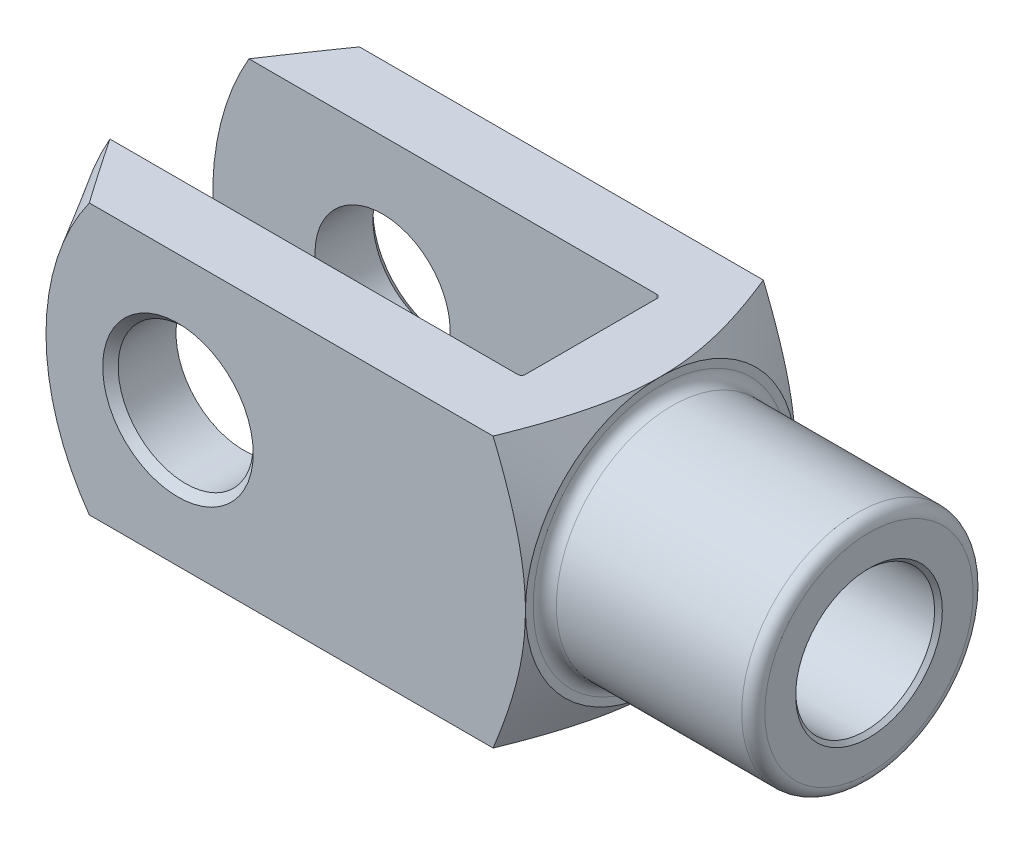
ISO-10303-21;
HEADER;
FILE_DESCRIPTION(('STEP AP214'),'2;1');
FILE_NAME('part.step','',(''),(''),'','','');
FILE_SCHEMA(('AUTOMOTIVE_DESIGN { 1 0 10303 214 1 1 1 1 }'));
ENDSEC;
DATA;
#1=APPLICATION_CONTEXT('core data for automotive mechanical design processes');
#2=APPLICATION_PROTOCOL_DEFINITION('international standard','automotive_design',2000,#1);
#3=PRODUCT_CONTEXT('',#1,'mechanical');
#4=PRODUCT('Part','Part','',(#3));
#5=PRODUCT_RELATED_PRODUCT_CATEGORY('part','',(#4));
#6=PRODUCT_DEFINITION_FORMATION('','',#4);
#7=PRODUCT_DEFINITION_CONTEXT('part definition',#1,'design');
#8=PRODUCT_DEFINITION('design','',#6,#7);
#9=PRODUCT_DEFINITION_SHAPE('','',#8);
#10=(LENGTH_UNIT() NAMED_UNIT(*) SI_UNIT(.MILLI.,.METRE.));
#11=(NAMED_UNIT(*) PLANE_ANGLE_UNIT() SI_UNIT($,.RADIAN.));
#12=(NAMED_UNIT(*) SI_UNIT($,.STERADIAN.) SOLID_ANGLE_UNIT());
#13=UNCERTAINTY_MEASURE_WITH_UNIT(LENGTH_MEASURE(1.E-05),#10,'distance_accuracy_value','');
#14=(GEOMETRIC_REPRESENTATION_CONTEXT(3) GLOBAL_UNCERTAINTY_ASSIGNED_CONTEXT((#13)) GLOBAL_UNIT_ASSIGNED_CONTEXT((#10,
#11,#12)) REPRESENTATION_CONTEXT('',''));
#15=CARTESIAN_POINT('',(0.,0.,0.));
#16=DIRECTION('',(0.,0.,1.));
#17=DIRECTION('',(1.,0.,0.));
#18=AXIS2_PLACEMENT_3D('',#15,#16,#17);
#19=CARTESIAN_POINT('',(-73.,-35.,-17.));
#20=DIRECTION('',(0.,-1.,0.));
#21=DIRECTION('',(0.,0.,-1.));
#22=AXIS2_PLACEMENT_3D('',#19,#20,#21);
#23=CYLINDRICAL_SURFACE('',#22,1.);
#24=DIRECTION('',(0.,1.,0.));
#25=VECTOR('',#24,1.);
#26=CARTESIAN_POINT('',(-72.,-35.,-17.));
#27=LINE('',#26,#25);
#28=CARTESIAN_POINT('',(-72.,-5.91607978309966,-17.));
#29=VERTEX_POINT('',#28);
#30=CARTESIAN_POINT('',(-72.,-35.,-17.));
#31=VERTEX_POINT('',#30);
#32=EDGE_CURVE('E357',#29,#31,#27,.F.);
#33=ORIENTED_EDGE('',*,*,#32,.F.);
#34=CARTESIAN_POINT('',(-72.,-5.91607978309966,-17.));
#35=CARTESIAN_POINT('',(-72.0000059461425,-5.83676482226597,-17.0276022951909));
#36=CARTESIAN_POINT('',(-72.0011421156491,-5.75726491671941,-17.0546459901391));
#37=CARTESIAN_POINT('',(-72.0054496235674,-5.59795427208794,-17.1075992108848));
#38=CARTESIAN_POINT('',(-72.0086206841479,-5.51814357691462,-17.1335088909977));
#39=CARTESIAN_POINT('',(-72.0208424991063,-5.27842664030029,-17.2094828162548));
#40=CARTESIAN_POINT('',(-72.0326026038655,-5.11811106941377,-17.2578352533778));
#41=CARTESIAN_POINT('',(-72.0619524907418,-4.79693886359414,-17.3498486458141));
#42=CARTESIAN_POINT('',(-72.0795340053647,-4.63608331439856,-17.3935161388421));
#43=CARTESIAN_POINT('',(-72.1194913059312,-4.31375067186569,-17.4762482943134));
#44=CARTESIAN_POINT('',(-72.1418684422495,-4.15227341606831,-17.5153116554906));
#45=CARTESIAN_POINT('',(-72.2156020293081,-3.6623695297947,-17.6266927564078));
#46=CARTESIAN_POINT('',(-72.2730770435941,-3.33320164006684,-17.691847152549));
#47=CARTESIAN_POINT('',(-72.3987344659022,-2.67378084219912,-17.8034505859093));
#48=CARTESIAN_POINT('',(-72.4669208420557,-2.3435275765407,-17.8498926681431));
#49=CARTESIAN_POINT('',(-72.6814368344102,-1.35151281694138,-17.9615200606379));
#50=CARTESIAN_POINT('',(-72.8377341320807,-0.688435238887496,-17.9990202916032));
#51=CARTESIAN_POINT('',(-72.9958961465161,-0.0174113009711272,-17.9999936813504));
#52=CARTESIAN_POINT('',(-72.9979481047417,-0.00870558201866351,-17.9999999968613));
#53=CARTESIAN_POINT('',(-73.,0.,-18.));
#54=B_SPLINE_CURVE_WITH_KNOTS('',3,(#34,#35,#36,#37,#38,#39,#40,#41,#42,#43,#44,#45,#46,#47,#48,
#49,#50,#51,#52,#53),.UNSPECIFIED.,.F.,.F.,(4,2,2,2,2,2,2,2,2,4),(0.,0.251917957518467,
0.503801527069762,1.00717378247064,1.50983419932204,2.01263634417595,3.03303739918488,
4.05381736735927,6.09518762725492,6.12202044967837),.UNSPECIFIED.);
#55=CARTESIAN_POINT('',(-73.,0.,-18.));
#56=VERTEX_POINT('',#55);
#57=EDGE_CURVE('E389',#29,#56,#54,.T.);
#58=ORIENTED_EDGE('',*,*,#57,.T.);
#59=DIRECTION('',(0.,1.,0.));
#60=VECTOR('',#59,1.);
#61=CARTESIAN_POINT('',(-73.,35.,-18.));
#62=LINE('',#61,#60);
#63=CARTESIAN_POINT('',(-73.,-35.,-18.));
#64=VERTEX_POINT('',#63);
#65=EDGE_CURVE('E183',#64,#56,#62,.T.);
#66=ORIENTED_EDGE('',*,*,#65,.F.);
#67=CARTESIAN_POINT('',(-73.,-35.,-17.));
#68=DIRECTION('',(0.,-1.,0.));
#69=DIRECTION('',(0.,0.,-1.));
#70=AXIS2_PLACEMENT_3D('',#67,#68,#69);
#71=CIRCLE('',#70,1.);
#72=EDGE_CURVE('E197',#31,#64,#71,.F.);
#73=ORIENTED_EDGE('',*,*,#72,.F.);
#74=EDGE_LOOP('',(#33,#58,#66,#73));
#75=FACE_BOUND('',#74,.T.);
#76=ADVANCED_FACE('F37',(#75),#23,.F.);
#77=CARTESIAN_POINT('',(-72.,-35.,-18.));
#78=DIRECTION('',(1.,0.,0.));
#79=DIRECTION('',(0.,0.,-1.));
#80=AXIS2_PLACEMENT_3D('',#77,#78,#79);
#81=PLANE('',#80);
#82=CARTESIAN_POINT('',(-72.,35.,-17.));
#83=VERTEX_POINT('',#82);
#84=CARTESIAN_POINT('',(-72.,5.91607978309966,-17.));
#85=VERTEX_POINT('',#84);
#86=EDGE_CURVE('E373',#83,#85,#27,.F.);
#87=ORIENTED_EDGE('',*,*,#86,.T.);
#88=CARTESIAN_POINT('',(-72.,0.,0.));
#89=DIRECTION('',(1.,0.,0.));
#90=DIRECTION('',(0.,0.,-1.));
#91=AXIS2_PLACEMENT_3D('',#88,#89,#90);
#92=CIRCLE('',#91,18.);
#93=CARTESIAN_POINT('',(-72.,5.9160797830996,17.));
#94=VERTEX_POINT('',#93);
#95=EDGE_CURVE('E413',#85,#94,#92,.T.);
#96=ORIENTED_EDGE('',*,*,#95,.T.);
#97=DIRECTION('',(0.,1.,0.));
#98=VECTOR('',#97,1.);
#99=CARTESIAN_POINT('',(-72.,35.,17.));
#100=LINE('',#99,#98);
#101=CARTESIAN_POINT('',(-72.,35.,17.));
#102=VERTEX_POINT('',#101);
#103=EDGE_CURVE('E160',#94,#102,#100,.T.);
#104=ORIENTED_EDGE('',*,*,#103,.T.);
#105=DIRECTION('',(0.,0.,-1.));
#106=VECTOR('',#105,1.);
#107=CARTESIAN_POINT('',(-72.,35.,-18.));
#108=LINE('',#107,#106);
#109=EDGE_CURVE('E337',#102,#83,#108,.T.);
#110=ORIENTED_EDGE('',*,*,#109,.T.);
#111=EDGE_LOOP('',(#87,#96,#104,#110));
#112=FACE_BOUND('',#111,.T.);
#113=ADVANCED_FACE('F471',(#112),#81,.F.);
#114=CARTESIAN_POINT('',(-73.,-35.,17.));
#115=DIRECTION('',(0.,-1.,0.));
#116=DIRECTION('',(0.,0.,-1.));
#117=AXIS2_PLACEMENT_3D('',#114,#115,#116);
#118=CYLINDRICAL_SURFACE('',#117,1.);
#119=ORIENTED_EDGE('',*,*,#103,.F.);
#120=CARTESIAN_POINT('',(-72.,5.9160797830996,17.));
#121=CARTESIAN_POINT('',(-72.0000059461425,5.83676482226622,17.0276022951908));
#122=CARTESIAN_POINT('',(-72.0011421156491,5.75726491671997,17.054645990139));
#123=CARTESIAN_POINT('',(-72.0054496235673,5.59795427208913,17.1075992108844));
#124=CARTESIAN_POINT('',(-72.0086206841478,5.51814357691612,17.1335088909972));
#125=CARTESIAN_POINT('',(-72.0208424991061,5.2784266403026,17.2094828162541));
#126=CARTESIAN_POINT('',(-72.0326026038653,5.11811106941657,17.257835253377));
#127=CARTESIAN_POINT('',(-72.0619524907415,4.79693886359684,17.3498486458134));
#128=CARTESIAN_POINT('',(-72.0795340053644,4.63608331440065,17.3935161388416));
#129=CARTESIAN_POINT('',(-72.1194913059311,4.31375067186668,17.4762482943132));
#130=CARTESIAN_POINT('',(-72.1418684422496,4.15227341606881,17.5153116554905));
#131=CARTESIAN_POINT('',(-72.2156020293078,3.6623695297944,17.6266927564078));
#132=CARTESIAN_POINT('',(-72.2730770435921,3.333201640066,17.6918471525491));
#133=CARTESIAN_POINT('',(-72.3987344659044,2.67378084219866,17.8034505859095));
#134=CARTESIAN_POINT('',(-72.4669208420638,2.34352757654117,17.8498926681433));
#135=CARTESIAN_POINT('',(-72.6814368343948,1.35151281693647,17.9615200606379));
#136=CARTESIAN_POINT('',(-72.8377341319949,0.688435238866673,17.9990202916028));
#137=CARTESIAN_POINT('',(-72.9958961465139,0.0174113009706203,17.9999936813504));
#138=CARTESIAN_POINT('',(-72.9979481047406,0.00870558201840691,17.9999999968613));
#139=CARTESIAN_POINT('',(-73.,0.,18.));
#140=B_SPLINE_CURVE_WITH_KNOTS('',3,(#120,#121,#122,#123,#124,#125,#126,#127,#128,#129,#130,
#131,#132,#133,#134,#135,#136,#137,#138,#139),.UNSPECIFIED.,.F.,.F.,(4,2,2,2,2,2,2,2,2,4),(0.,
0.251917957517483,0.503801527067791,1.00717378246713,1.50983419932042,2.01263634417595,
3.03303739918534,4.05381736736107,6.09518762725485,6.12202044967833),.UNSPECIFIED.);
#141=CARTESIAN_POINT('',(-73.,0.,18.));
#142=VERTEX_POINT('',#141);
#143=EDGE_CURVE('E145',#94,#142,#140,.T.);
#144=ORIENTED_EDGE('',*,*,#143,.T.);
#145=DIRECTION('',(0.,1.,0.));
#146=VECTOR('',#145,1.);
#147=CARTESIAN_POINT('',(-73.,-35.,18.));
#148=LINE('',#147,#146);
#149=CARTESIAN_POINT('',(-73.,35.,18.));
#150=VERTEX_POINT('',#149);
#151=EDGE_CURVE('E159',#150,#142,#148,.F.);
#152=ORIENTED_EDGE('',*,*,#151,.F.);
#153=CARTESIAN_POINT('',(-73.,35.,17.));
#154=DIRECTION('',(0.,1.,0.));
#155=DIRECTION('',(0.,0.,1.));
#156=AXIS2_PLACEMENT_3D('',#153,#154,#155);
#157=CIRCLE('',#156,1.);
#158=EDGE_CURVE('E190',#102,#150,#157,.F.);
#159=ORIENTED_EDGE('',*,*,#158,.F.);
#160=EDGE_LOOP('',(#119,#144,#152,#159));
#161=FACE_BOUND('',#160,.T.);
#162=ADVANCED_FACE('F156',(#161),#118,.F.);
#163=CARTESIAN_POINT('',(-188.,-35.,-18.));
#164=DIRECTION('',(0.,0.,-1.));
#165=DIRECTION('',(-1.,0.,0.));
#166=AXIS2_PLACEMENT_3D('',#163,#164,#165);
#167=PLANE('',#166);
#168=CARTESIAN_POINT('',(-144.,0.,-18.));
#169=DIRECTION('',(0.,0.,-1.));
#170=DIRECTION('',(-1.,0.,0.));
#171=AXIS2_PLACEMENT_3D('',#168,#169,#170);
#172=CIRCLE('',#171,17.5);
#173=CARTESIAN_POINT('',(-161.5,0.,-18.));
#174=VERTEX_POINT('',#173);
#175=EDGE_CURVE('E367',#174,#174,#172,.F.);
#176=ORIENTED_EDGE('',*,*,#175,.F.);
#177=EDGE_LOOP('',(#176));
#178=FACE_BOUND('',#177,.T.);
#179=CARTESIAN_POINT('',(-118.,0.,-18.));
#180=DIRECTION('',(0.,0.,1.));
#181=DIRECTION('',(1.,0.,0.));
#182=AXIS2_PLACEMENT_3D('',#179,#180,#181);
#183=CIRCLE('',#182,70.);
#184=CARTESIAN_POINT('',(-178.621778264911,35.,-18.));
#185=VERTEX_POINT('',#184);
#186=CARTESIAN_POINT('',(-178.621778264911,-35.,-18.));
#187=VERTEX_POINT('',#186);
#188=EDGE_CURVE('E275',#185,#187,#183,.T.);
#189=ORIENTED_EDGE('',*,*,#188,.T.);
#190=DIRECTION('',(-1.,0.,0.));
#191=VECTOR('',#190,1.);
#192=CARTESIAN_POINT('',(-188.,-35.,-18.));
#193=LINE('',#192,#191);
#194=EDGE_CURVE('E332',#64,#187,#193,.T.);
#195=ORIENTED_EDGE('',*,*,#194,.F.);
#196=ORIENTED_EDGE('',*,*,#65,.T.);
#197=CARTESIAN_POINT('',(-73.,35.,-18.));
#198=VERTEX_POINT('',#197);
#199=EDGE_CURVE('E179',#56,#198,#62,.T.);
#200=ORIENTED_EDGE('',*,*,#199,.T.);
#201=DIRECTION('',(-1.,0.,0.));
#202=VECTOR('',#201,1.);
#203=CARTESIAN_POINT('',(-188.,35.,-18.));
#204=LINE('',#203,#202);
#205=EDGE_CURVE('E345',#198,#185,#204,.T.);
#206=ORIENTED_EDGE('',*,*,#205,.T.);
#207=EDGE_LOOP('',(#189,#195,#196,#200,#206));
#208=FACE_BOUND('',#207,.T.);
#209=ADVANCED_FACE('F392',(#178,#208),#167,.F.);
#210=CARTESIAN_POINT('',(-188.,-35.,18.));
#211=DIRECTION('',(0.,0.,1.));
#212=DIRECTION('',(1.,0.,0.));
#213=AXIS2_PLACEMENT_3D('',#210,#211,#212);
#214=PLANE('',#213);
#215=CARTESIAN_POINT('',(-144.,0.,18.));
#216=DIRECTION('',(0.,0.,1.));
#217=DIRECTION('',(1.,0.,0.));
#218=AXIS2_PLACEMENT_3D('',#215,#216,#217);
#219=CIRCLE('',#218,17.5);
#220=CARTESIAN_POINT('',(-126.5,0.,18.));
#221=VERTEX_POINT('',#220);
#222=EDGE_CURVE('E344',#221,#221,#219,.F.);
#223=ORIENTED_EDGE('',*,*,#222,.F.);
#224=EDGE_LOOP('',(#223));
#225=FACE_BOUND('',#224,.T.);
#226=DIRECTION('',(1.,0.,0.));
#227=VECTOR('',#226,1.);
#228=CARTESIAN_POINT('',(-188.,-35.,18.));
#229=LINE('',#228,#227);
#230=CARTESIAN_POINT('',(-178.621778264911,-35.,18.));
#231=VERTEX_POINT('',#230);
#232=CARTESIAN_POINT('',(-73.,-35.,18.));
#233=VERTEX_POINT('',#232);
#234=EDGE_CURVE('E336',#231,#233,#229,.T.);
#235=ORIENTED_EDGE('',*,*,#234,.F.);
#236=CARTESIAN_POINT('',(-118.,0.,18.));
#237=DIRECTION('',(0.,0.,1.));
#238=DIRECTION('',(1.,0.,0.));
#239=AXIS2_PLACEMENT_3D('',#236,#237,#238);
#240=CIRCLE('',#239,70.);
#241=CARTESIAN_POINT('',(-178.621778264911,35.,18.));
#242=VERTEX_POINT('',#241);
#243=EDGE_CURVE('E419',#242,#231,#240,.T.);
#244=ORIENTED_EDGE('',*,*,#243,.F.);
#245=DIRECTION('',(1.,0.,0.));
#246=VECTOR('',#245,1.);
#247=CARTESIAN_POINT('',(-188.,35.,18.));
#248=LINE('',#247,#246);
#249=EDGE_CURVE('E176',#242,#150,#248,.T.);
#250=ORIENTED_EDGE('',*,*,#249,.T.);
#251=ORIENTED_EDGE('',*,*,#151,.T.);
#252=EDGE_CURVE('E164',#142,#233,#148,.F.);
#253=ORIENTED_EDGE('',*,*,#252,.T.);
#254=EDGE_LOOP('',(#235,#244,#250,#251,#253));
#255=FACE_BOUND('',#254,.T.);
#256=ADVANCED_FACE('F173',(#225,#255),#214,.F.);
#257=CARTESIAN_POINT('',(-188.,-35.,35.));
#258=DIRECTION('',(0.,0.,1.));
#259=DIRECTION('',(1.,0.,0.));
#260=AXIS2_PLACEMENT_3D('',#257,#258,#259);
#261=PLANE('',#260);
#262=CARTESIAN_POINT('',(-144.,0.,35.));
#263=DIRECTION('',(0.,0.,1.));
#264=DIRECTION('',(1.,0.,0.));
#265=AXIS2_PLACEMENT_3D('',#262,#263,#264);
#266=CIRCLE('',#265,19.5);
#267=CARTESIAN_POINT('',(-124.5,0.,35.));
#268=VERTEX_POINT('',#267);
#269=EDGE_CURVE('E227',#268,#268,#266,.F.);
#270=ORIENTED_EDGE('',*,*,#269,.T.);
#271=EDGE_LOOP('',(#270));
#272=FACE_BOUND('',#271,.T.);
#273=DIRECTION('',(1.,0.,0.));
#274=VECTOR('',#273,1.);
#275=CARTESIAN_POINT('',(-188.,35.,35.));
#276=LINE('',#275,#274);
#277=CARTESIAN_POINT('',(-166.961614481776,35.,35.));
#278=VERTEX_POINT('',#277);
#279=CARTESIAN_POINT('',(-62.3701209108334,35.,35.));
#280=VERTEX_POINT('',#279);
#281=EDGE_CURVE('E364',#278,#280,#276,.T.);
#282=ORIENTED_EDGE('',*,*,#281,.F.);
#283=CARTESIAN_POINT('',(-118.,0.,35.));
#284=DIRECTION('',(0.,0.,1.));
#285=DIRECTION('',(1.,0.,0.));
#286=AXIS2_PLACEMENT_3D('',#283,#284,#285);
#287=CIRCLE('',#286,60.1850454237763);
#288=CARTESIAN_POINT('',(-166.961614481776,-35.,35.));
#289=VERTEX_POINT('',#288);
#290=EDGE_CURVE('E61',#278,#289,#287,.T.);
#291=ORIENTED_EDGE('',*,*,#290,.T.);
#292=DIRECTION('',(1.,0.,0.));
#293=VECTOR('',#292,1.);
#294=CARTESIAN_POINT('',(-188.,-35.,35.));
#295=LINE('',#294,#293);
#296=CARTESIAN_POINT('',(-62.3701209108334,-35.,35.));
#297=VERTEX_POINT('',#296);
#298=EDGE_CURVE('E361',#289,#297,#295,.T.);
#299=ORIENTED_EDGE('',*,*,#298,.T.);
#300=CARTESIAN_POINT('',(-79.7455571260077,-71.4841524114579,35.));
#301=CARTESIAN_POINT('',(-79.2983354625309,-70.6216687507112,35.));
#302=CARTESIAN_POINT('',(-78.8523395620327,-69.7585498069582,35.));
#303=CARTESIAN_POINT('',(-77.9630613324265,-68.0309117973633,35.));
#304=CARTESIAN_POINT('',(-77.5197790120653,-67.1663927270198,35.));
#305=CARTESIAN_POINT('',(-76.1943552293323,-64.5704620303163,35.));
#306=CARTESIAN_POINT('',(-75.3166821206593,-62.8367639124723,35.));
#307=CARTESIAN_POINT('',(-73.5744168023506,-59.3590234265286,35.));
#308=CARTESIAN_POINT('',(-72.7098500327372,-57.6149683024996,35.));
#309=CARTESIAN_POINT('',(-70.9988898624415,-54.1179792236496,35.));
#310=CARTESIAN_POINT('',(-70.1524961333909,-52.3650454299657,35.));
#311=CARTESIAN_POINT('',(-68.8743862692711,-49.673396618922,35.));
#312=CARTESIAN_POINT('',(-68.4344483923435,-48.7385836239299,35.));
#313=CARTESIAN_POINT('',(-67.5619188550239,-46.865537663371,35.));
#314=CARTESIAN_POINT('',(-67.1293271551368,-45.9273047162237,35.));
#315=CARTESIAN_POINT('',(-66.2724882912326,-44.0469670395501,35.));
#316=CARTESIAN_POINT('',(-65.8482416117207,-43.1048620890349,35.));
#317=CARTESIAN_POINT('',(-65.0093315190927,-41.2163859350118,35.));
#318=CARTESIAN_POINT('',(-64.594668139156,-40.2700147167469,35.));
#319=CARTESIAN_POINT('',(-63.7765361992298,-38.3729279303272,35.));
#320=CARTESIAN_POINT('',(-63.3730628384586,-37.4222144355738,35.));
#321=CARTESIAN_POINT('',(-62.5788187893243,-35.5154994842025,35.));
#322=CARTESIAN_POINT('',(-62.1880479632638,-34.5594980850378,35.));
#323=CARTESIAN_POINT('',(-61.4212481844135,-32.6417187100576,35.));
#324=CARTESIAN_POINT('',(-61.0452174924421,-31.6799414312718,35.));
#325=CARTESIAN_POINT('',(-60.3101986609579,-29.7498374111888,35.));
#326=CARTESIAN_POINT('',(-59.9512112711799,-28.781510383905,35.));
#327=CARTESIAN_POINT('',(-59.1773660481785,-26.6269700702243,35.));
#328=CARTESIAN_POINT('',(-58.7672704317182,-25.4390360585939,35.));
#329=CARTESIAN_POINT('',(-57.9823694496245,-23.0516177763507,35.));
#330=CARTESIAN_POINT('',(-57.6075610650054,-21.8521345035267,35.));
#331=CARTESIAN_POINT('',(-56.9001918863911,-19.4407071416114,35.));
#332=CARTESIAN_POINT('',(-56.5676302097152,-18.2287633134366,35.));
#333=CARTESIAN_POINT('',(-55.9526962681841,-15.79212691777,35.));
#334=CARTESIAN_POINT('',(-55.6703234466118,-14.5674344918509,35.));
#335=CARTESIAN_POINT('',(-55.1702230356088,-12.1346782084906,35.));
#336=CARTESIAN_POINT('',(-54.9511335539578,-10.926898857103,35.));
#337=CARTESIAN_POINT('',(-54.6702587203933,-9.10791584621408,35.));
#338=CARTESIAN_POINT('',(-54.5845910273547,-8.50034299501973,35.));
#339=CARTESIAN_POINT('',(-54.4300119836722,-7.28307909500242,35.));
#340=CARTESIAN_POINT('',(-54.3610998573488,-6.67338814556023,35.));
#341=CARTESIAN_POINT('',(-54.2408047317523,-5.45265711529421,35.));
#342=CARTESIAN_POINT('',(-54.1894109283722,-4.84161810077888,35.));
#343=CARTESIAN_POINT('',(-54.1046686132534,-3.61828422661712,35.));
#344=CARTESIAN_POINT('',(-54.0713201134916,-3.00598936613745,35.));
#345=CARTESIAN_POINT('',(-54.0230583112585,-1.78068731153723,35.));
#346=CARTESIAN_POINT('',(-54.0081445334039,-1.16768013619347,35.));
#347=CARTESIAN_POINT('',(-53.9969287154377,0.0585026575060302,35.));
#348=CARTESIAN_POINT('',(-54.0006265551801,0.67167827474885,35.));
#349=CARTESIAN_POINT('',(-54.0256414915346,1.85294442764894,35.));
#350=CARTESIAN_POINT('',(-54.0456545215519,2.42106307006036,35.));
#351=CARTESIAN_POINT('',(-54.1014333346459,3.55654632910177,35.));
#352=CARTESIAN_POINT('',(-54.1371997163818,4.12391091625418,35.));
#353=CARTESIAN_POINT('',(-54.2241302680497,5.25742922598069,35.));
#354=CARTESIAN_POINT('',(-54.2752936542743,5.82358300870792,35.));
#355=CARTESIAN_POINT('',(-54.3925261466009,6.95435287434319,35.));
#356=CARTESIAN_POINT('',(-54.4585958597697,7.51896889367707,35.));
#357=CARTESIAN_POINT('',(-54.6783609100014,9.21054236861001,35.));
#358=CARTESIAN_POINT('',(-54.8535756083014,10.3347599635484,35.));
#359=CARTESIAN_POINT('',(-55.2556333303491,12.5738033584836,35.));
#360=CARTESIAN_POINT('',(-55.4824777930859,13.6886288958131,35.));
#361=CARTESIAN_POINT('',(-55.9887006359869,15.94014365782,35.));
#362=CARTESIAN_POINT('',(-56.2694095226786,17.0765317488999,35.));
#363=CARTESIAN_POINT('',(-56.8720367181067,19.3382710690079,35.));
#364=CARTESIAN_POINT('',(-57.1939554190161,20.4636221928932,35.));
#365=CARTESIAN_POINT('',(-57.703069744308,22.1435871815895,35.));
#366=CARTESIAN_POINT('',(-57.8771454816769,22.7022267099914,35.));
#367=CARTESIAN_POINT('',(-58.2333547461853,23.8169352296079,35.));
#368=CARTESIAN_POINT('',(-58.4154882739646,24.3730042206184,35.));
#369=CARTESIAN_POINT('',(-58.7871408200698,25.4826284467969,35.));
#370=CARTESIAN_POINT('',(-58.9766594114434,26.0361838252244,35.));
#371=CARTESIAN_POINT('',(-59.362488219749,27.1409163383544,35.));
#372=CARTESIAN_POINT('',(-59.5587984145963,27.6920934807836,35.));
#373=CARTESIAN_POINT('',(-60.1895678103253,29.4318816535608,35.));
#374=CARTESIAN_POINT('',(-60.6354807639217,30.6163513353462,35.));
#375=CARTESIAN_POINT('',(-61.5515172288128,32.9759195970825,35.));
#376=CARTESIAN_POINT('',(-62.0216421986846,34.1510176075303,35.));
#377=CARTESIAN_POINT('',(-62.982193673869,36.4931780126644,35.));
#378=CARTESIAN_POINT('',(-63.4726247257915,37.6602385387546,35.));
#379=CARTESIAN_POINT('',(-64.4704100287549,39.9870590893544,35.));
#380=CARTESIAN_POINT('',(-64.9777639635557,41.1468192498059,35.));
#381=CARTESIAN_POINT('',(-66.0071895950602,43.4609776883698,35.));
#382=CARTESIAN_POINT('',(-66.5292736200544,44.6153704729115,35.));
#383=CARTESIAN_POINT('',(-67.5855656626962,46.9185930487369,35.));
#384=CARTESIAN_POINT('',(-68.1197737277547,48.0674228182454,35.));
#385=CARTESIAN_POINT('',(-69.1984683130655,50.36008259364,35.));
#386=CARTESIAN_POINT('',(-69.74295366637,51.5039131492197,35.));
#387=CARTESIAN_POINT('',(-70.8407931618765,53.7873038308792,35.));
#388=CARTESIAN_POINT('',(-71.3941472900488,54.9268639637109,35.));
#389=CARTESIAN_POINT('',(-72.5102077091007,57.2056982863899,35.));
#390=CARTESIAN_POINT('',(-73.0729373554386,58.3449610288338,35.));
#391=CARTESIAN_POINT('',(-74.2050779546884,60.620159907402,35.));
#392=CARTESIAN_POINT('',(-74.774488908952,61.7560960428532,35.));
#393=CARTESIAN_POINT('',(-75.919147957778,64.0250497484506,35.));
#394=CARTESIAN_POINT('',(-76.4943961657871,65.1580672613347,35.));
#395=CARTESIAN_POINT('',(-77.6500048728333,67.4214931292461,35.));
#396=CARTESIAN_POINT('',(-78.2303653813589,68.5519014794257,35.));
#397=CARTESIAN_POINT('',(-79.9775989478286,71.9385331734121,35.));
#398=CARTESIAN_POINT('',(-81.151193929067,74.1912896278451,35.));
#399=CARTESIAN_POINT('',(-83.512438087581,78.6893897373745,35.));
#400=CARTESIAN_POINT('',(-84.7000871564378,80.934733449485,35.));
#401=CARTESIAN_POINT('',(-86.9094378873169,85.0864160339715,35.));
#402=CARTESIAN_POINT('',(-87.9295909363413,86.9935796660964,35.));
#403=CARTESIAN_POINT('',(-89.9767304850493,90.8042363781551,35.));
#404=CARTESIAN_POINT('',(-91.0037169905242,92.7077294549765,35.));
#405=CARTESIAN_POINT('',(-93.0635983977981,96.5118602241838,35.));
#406=CARTESIAN_POINT('',(-94.0964941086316,98.4124974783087,35.));
#407=CARTESIAN_POINT('',(-96.1671930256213,102.211097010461,35.));
#408=CARTESIAN_POINT('',(-97.2049962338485,104.109059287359,35.));
#409=CARTESIAN_POINT('',(-99.2788542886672,107.891810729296,35.));
#410=CARTESIAN_POINT('',(-100.314885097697,109.776613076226,35.));
#411=CARTESIAN_POINT('',(-102.390544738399,113.544235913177,35.));
#412=CARTESIAN_POINT('',(-103.430173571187,115.427056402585,35.));
#413=CARTESIAN_POINT('',(-105.51239361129,119.190669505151,35.));
#414=CARTESIAN_POINT('',(-106.55498432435,121.071462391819,35.));
#415=CARTESIAN_POINT('',(-108.642913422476,124.831519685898,35.));
#416=CARTESIAN_POINT('',(-109.68825180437,126.710784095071,35.));
#417=CARTESIAN_POINT('',(-110.734776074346,128.589387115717,35.));
#418=B_SPLINE_CURVE_WITH_KNOTS('',3,(#300,#301,#302,#303,#304,#305,#306,#307,#308,#309,#310,
#311,#312,#313,#314,#315,#316,#317,#318,#319,#320,#321,#322,#323,#324,#325,#326,#327,#328,#329,
#330,#331,#332,#333,#334,#335,#336,#337,#338,#339,#340,#341,#342,#343,#344,#345,#346,#347,#348,
#349,#350,#351,#352,#353,#354,#355,#356,#357,#358,#359,#360,#361,#362,#363,#364,#365,#366,#367,
#368,#369,#370,#371,#372,#373,#374,#375,#376,#377,#378,#379,#380,#381,#382,#383,#384,#385,#386,
#387,#388,#389,#390,#391,#392,#393,#394,#395,#396,#397,#398,#399,#400,#401,#402,#403,#404,#405,
#406,#407,#408,#409,#410,#411,#412,#413,#414,#415,#416,#417),.UNSPECIFIED.,.F.,.F.,(4,2,2,2,2,2,
2,2,2,2,2,2,2,2,2,2,2,2,2,2,2,2,2,2,2,2,2,2,2,2,2,2,2,2,2,2,2,2,2,2,2,2,2,2,2,2,2,2,2,2,2,2,2,2,
2,2,2,2,4),(0.,2.91461071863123,5.82923082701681,11.6587651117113,17.4984507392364,
23.3380307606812,26.437486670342,29.5369259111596,32.6365445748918,35.7361739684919,
38.8344523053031,41.9326970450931,45.0305751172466,48.128589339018,51.8983063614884,
55.6677005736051,59.4370160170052,63.206289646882,66.8870829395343,68.7276372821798,
70.5681064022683,72.4074383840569,74.2467715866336,76.0860573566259,77.9253312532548,
79.6305250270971,81.3357836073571,83.0409554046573,84.7461966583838,88.1580776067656,
91.5700536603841,95.0807863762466,98.5915525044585,100.346902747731,102.102253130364,
103.857502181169,105.6127455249,109.409260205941,113.206003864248,117.003602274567,
120.801129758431,124.601935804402,128.402756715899,132.203148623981,136.003534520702,
139.815498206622,143.627462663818,147.439501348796,151.251547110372,158.871851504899,
166.492097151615,172.980676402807,179.469261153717,185.958756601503,192.448254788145,
198.900579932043,205.352907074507,211.804214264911,218.255514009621),.UNSPECIFIED.);
#419=CARTESIAN_POINT('',(-54.,0.,35.));
#420=VERTEX_POINT('',#419);
#421=EDGE_CURVE('E304',#420,#297,#418,.F.);
#422=ORIENTED_EDGE('',*,*,#421,.F.);
#423=EDGE_CURVE('E302',#280,#420,#418,.F.);
#424=ORIENTED_EDGE('',*,*,#423,.F.);
#425=EDGE_LOOP('',(#282,#291,#299,#422,#424));
#426=FACE_BOUND('',#425,.T.);
#427=ADVANCED_FACE('F286',(#272,#426),#261,.T.);
#428=CARTESIAN_POINT('',(-188.,-35.,35.));
#429=DIRECTION('',(0.,-1.,0.));
#430=DIRECTION('',(0.,0.,-1.));
#431=AXIS2_PLACEMENT_3D('',#428,#429,#430);
#432=PLANE('',#431);
#433=ORIENTED_EDGE('',*,*,#194,.T.);
#434=CARTESIAN_POINT('',(-222.520724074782,-35.,51.671988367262));
#435=CARTESIAN_POINT('',(-221.554576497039,-35.,50.0851805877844));
#436=CARTESIAN_POINT('',(-220.587448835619,-35.,48.4989695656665));
#437=CARTESIAN_POINT('',(-218.651053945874,-35.,45.3278535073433));
#438=CARTESIAN_POINT('',(-217.681786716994,-35.,43.7429484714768));
#439=CARTESIAN_POINT('',(-214.770491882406,-35.,38.9903370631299));
#440=CARTESIAN_POINT('',(-212.824986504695,-35.,35.8247596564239));
#441=CARTESIAN_POINT('',(-208.922714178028,-35.,29.5000306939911));
#442=CARTESIAN_POINT('',(-206.965945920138,-35.,26.3408799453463));
#443=CARTESIAN_POINT('',(-204.020819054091,-35.,21.6083698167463));
#444=CARTESIAN_POINT('',(-203.037449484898,-35.,20.0319053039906));
#445=CARTESIAN_POINT('',(-201.067026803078,-35.,16.8812746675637));
#446=CARTESIAN_POINT('',(-200.079973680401,-35.,15.3071085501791));
#447=CARTESIAN_POINT('',(-197.117103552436,-35.,10.5953823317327));
#448=CARTESIAN_POINT('',(-195.135238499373,-35.,7.46161750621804));
#449=CARTESIAN_POINT('',(-192.147442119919,-35.,2.77053256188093));
#450=CARTESIAN_POINT('',(-191.149011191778,-35.,1.20843284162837));
#451=CARTESIAN_POINT('',(-189.14652995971,-35.,-1.9121598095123));
#452=CARTESIAN_POINT('',(-188.142479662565,-35.,-3.47065274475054));
#453=CARTESIAN_POINT('',(-186.128018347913,-35.,-6.58361608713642));
#454=CARTESIAN_POINT('',(-185.117607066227,-35.,-8.13808632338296));
#455=CARTESIAN_POINT('',(-183.089635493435,-35.,-11.2423595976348));
#456=CARTESIAN_POINT('',(-182.072075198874,-35.,-12.7921626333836));
#457=CARTESIAN_POINT('',(-180.02883490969,-35.,-15.8863865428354));
#458=CARTESIAN_POINT('',(-179.003154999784,-35.,-17.4308074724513));
#459=CARTESIAN_POINT('',(-176.942493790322,-35.,-20.5134279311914));
#460=CARTESIAN_POINT('',(-175.907512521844,-35.,-22.0516274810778));
#461=CARTESIAN_POINT('',(-173.825154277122,-35.,-25.1232323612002));
#462=CARTESIAN_POINT('',(-172.777760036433,-35.,-26.6566259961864));
#463=CARTESIAN_POINT('',(-170.670487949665,-35.,-29.7148010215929));
#464=CARTESIAN_POINT('',(-169.610610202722,-35.,-31.2395824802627));
#465=CARTESIAN_POINT('',(-167.476483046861,-35.,-34.2785157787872));
#466=CARTESIAN_POINT('',(-166.402237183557,-35.,-35.7926701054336));
#467=CARTESIAN_POINT('',(-164.236427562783,-35.,-38.8086156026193));
#468=CARTESIAN_POINT('',(-163.144863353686,-35.,-40.3104064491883));
#469=CARTESIAN_POINT('',(-160.939743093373,-35.,-43.3006083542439));
#470=CARTESIAN_POINT('',(-159.826162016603,-35.,-44.7890010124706));
#471=CARTESIAN_POINT('',(-158.137031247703,-35.,-47.0072239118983));
#472=CARTESIAN_POINT('',(-157.570878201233,-35.,-47.7442155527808));
#473=CARTESIAN_POINT('',(-156.431628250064,-35.,-49.21280898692));
#474=CARTESIAN_POINT('',(-155.858531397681,-35.,-49.9444108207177));
#475=CARTESIAN_POINT('',(-154.704190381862,-35.,-51.4020845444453));
#476=CARTESIAN_POINT('',(-154.122940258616,-35.,-52.1281517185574));
#477=CARTESIAN_POINT('',(-152.951855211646,-35.,-53.5733147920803));
#478=CARTESIAN_POINT('',(-152.362020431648,-35.,-54.2924108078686));
#479=CARTESIAN_POINT('',(-151.17260637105,-35.,-55.7228130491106));
#480=CARTESIAN_POINT('',(-150.573024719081,-35.,-56.4341173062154));
#481=CARTESIAN_POINT('',(-149.363002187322,-35.,-57.8474945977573));
#482=CARTESIAN_POINT('',(-148.752560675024,-35.,-58.5495670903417));
#483=CARTESIAN_POINT('',(-148.136095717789,-35.,-59.2463516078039));
#484=B_SPLINE_CURVE_WITH_KNOTS('',3,(#434,#435,#436,#437,#438,#439,#440,#441,#442,#443,#444,
#445,#446,#447,#448,#449,#450,#451,#452,#453,#454,#455,#456,#457,#458,#459,#460,#461,#462,#463,
#464,#465,#466,#467,#468,#469,#470,#471,#472,#473,#474,#475,#476,#477,#478,#479,#480,#481,#482,
#483),.UNSPECIFIED.,.F.,.F.,(4,2,2,2,2,2,2,2,2,2,2,2,2,2,2,2,2,2,2,2,2,2,2,2,4),(0.,
5.57338268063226,11.1467668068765,22.2936237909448,33.4418034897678,39.0158730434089,
44.5899578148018,55.7134821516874,61.2752332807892,66.836977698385,72.3989546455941,
77.9609342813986,83.5228559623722,89.0847590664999,94.655610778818,100.226418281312,
105.795875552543,111.365478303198,116.94182418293,119.729831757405,122.517818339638,
125.307961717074,128.09805843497,130.888844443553,133.679793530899),.UNSPECIFIED.);
#485=CARTESIAN_POINT('',(-166.961614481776,-35.,-35.));
#486=VERTEX_POINT('',#485);
#487=EDGE_CURVE('E274',#187,#486,#484,.T.);
#488=ORIENTED_EDGE('',*,*,#487,.T.);
#489=DIRECTION('',(1.,0.,0.));
#490=VECTOR('',#489,1.);
#491=CARTESIAN_POINT('',(-188.,-35.,-35.));
#492=LINE('',#491,#490);
#493=CARTESIAN_POINT('',(-62.3701209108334,-35.,-35.));
#494=VERTEX_POINT('',#493);
#495=EDGE_CURVE('E358',#486,#494,#492,.T.);
#496=ORIENTED_EDGE('',*,*,#495,.T.);
#497=CARTESIAN_POINT('',(-79.7455571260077,-35.,-71.4841524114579));
#498=CARTESIAN_POINT('',(-79.2983354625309,-35.,-70.6216687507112));
#499=CARTESIAN_POINT('',(-78.8523395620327,-35.,-69.7585498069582));
#500=CARTESIAN_POINT('',(-77.9630613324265,-35.,-68.0309117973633));
#501=CARTESIAN_POINT('',(-77.5197790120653,-35.,-67.1663927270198));
#502=CARTESIAN_POINT('',(-76.1943552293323,-35.,-64.5704620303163));
#503=CARTESIAN_POINT('',(-75.3166821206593,-35.,-62.8367639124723));
#504=CARTESIAN_POINT('',(-73.5744168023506,-35.,-59.3590234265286));
#505=CARTESIAN_POINT('',(-72.7098500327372,-35.,-57.6149683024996));
#506=CARTESIAN_POINT('',(-70.9988898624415,-35.,-54.1179792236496));
#507=CARTESIAN_POINT('',(-70.1524961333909,-35.,-52.3650454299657));
#508=CARTESIAN_POINT('',(-68.8743862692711,-35.,-49.673396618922));
#509=CARTESIAN_POINT('',(-68.4344483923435,-35.,-48.7385836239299));
#510=CARTESIAN_POINT('',(-67.5619188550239,-35.,-46.865537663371));
#511=CARTESIAN_POINT('',(-67.1293271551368,-35.,-45.9273047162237));
#512=CARTESIAN_POINT('',(-66.2724882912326,-35.,-44.0469670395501));
#513=CARTESIAN_POINT('',(-65.8482416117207,-35.,-43.1048620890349));
#514=CARTESIAN_POINT('',(-65.0093315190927,-35.,-41.2163859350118));
#515=CARTESIAN_POINT('',(-64.594668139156,-35.,-40.2700147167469));
#516=CARTESIAN_POINT('',(-63.7765361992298,-35.,-38.3729279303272));
#517=CARTESIAN_POINT('',(-63.3730628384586,-35.,-37.4222144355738));
#518=CARTESIAN_POINT('',(-62.5788187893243,-35.,-35.5154994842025));
#519=CARTESIAN_POINT('',(-62.1880479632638,-35.,-34.5594980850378));
#520=CARTESIAN_POINT('',(-61.4212481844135,-35.,-32.6417187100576));
#521=CARTESIAN_POINT('',(-61.0452174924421,-35.,-31.6799414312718));
#522=CARTESIAN_POINT('',(-60.3101986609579,-35.,-29.7498374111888));
#523=CARTESIAN_POINT('',(-59.9512112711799,-35.,-28.781510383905));
#524=CARTESIAN_POINT('',(-59.1773660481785,-35.,-26.6269700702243));
#525=CARTESIAN_POINT('',(-58.7672704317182,-35.,-25.4390360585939));
#526=CARTESIAN_POINT('',(-57.9823694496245,-35.,-23.0516177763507));
#527=CARTESIAN_POINT('',(-57.6075610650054,-35.,-21.8521345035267));
#528=CARTESIAN_POINT('',(-56.9001918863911,-35.,-19.4407071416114));
#529=CARTESIAN_POINT('',(-56.5676302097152,-35.,-18.2287633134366));
#530=CARTESIAN_POINT('',(-55.9526962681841,-35.,-15.79212691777));
#531=CARTESIAN_POINT('',(-55.6703234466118,-35.,-14.5674344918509));
#532=CARTESIAN_POINT('',(-55.1702230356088,-35.,-12.1346782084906));
#533=CARTESIAN_POINT('',(-54.9511335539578,-35.,-10.926898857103));
#534=CARTESIAN_POINT('',(-54.6702587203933,-35.,-9.10791584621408));
#535=CARTESIAN_POINT('',(-54.5845910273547,-35.,-8.50034299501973));
#536=CARTESIAN_POINT('',(-54.4300119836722,-35.,-7.28307909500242));
#537=CARTESIAN_POINT('',(-54.3610998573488,-35.,-6.67338814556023));
#538=CARTESIAN_POINT('',(-54.2408047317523,-35.,-5.45265711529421));
#539=CARTESIAN_POINT('',(-54.1894109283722,-35.,-4.84161810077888));
#540=CARTESIAN_POINT('',(-54.1046686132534,-35.,-3.61828422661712));
#541=CARTESIAN_POINT('',(-54.0713201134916,-35.,-3.00598936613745));
#542=CARTESIAN_POINT('',(-54.0230583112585,-35.,-1.78068731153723));
#543=CARTESIAN_POINT('',(-54.0081445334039,-35.,-1.16768013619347));
#544=CARTESIAN_POINT('',(-53.9969287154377,-35.,0.0585026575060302));
#545=CARTESIAN_POINT('',(-54.0006265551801,-35.,0.67167827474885));
#546=CARTESIAN_POINT('',(-54.0256414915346,-35.,1.85294442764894));
#547=CARTESIAN_POINT('',(-54.0456545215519,-35.,2.42106307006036));
#548=CARTESIAN_POINT('',(-54.1014333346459,-35.,3.55654632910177));
#549=CARTESIAN_POINT('',(-54.1371997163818,-35.,4.12391091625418));
#550=CARTESIAN_POINT('',(-54.2241302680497,-35.,5.25742922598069));
#551=CARTESIAN_POINT('',(-54.2752936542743,-35.,5.82358300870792));
#552=CARTESIAN_POINT('',(-54.3925261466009,-35.,6.95435287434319));
#553=CARTESIAN_POINT('',(-54.4585958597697,-35.,7.51896889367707));
#554=CARTESIAN_POINT('',(-54.6783609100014,-35.,9.21054236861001));
#555=CARTESIAN_POINT('',(-54.8535756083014,-35.,10.3347599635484));
#556=CARTESIAN_POINT('',(-55.2556333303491,-35.,12.5738033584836));
#557=CARTESIAN_POINT('',(-55.4824777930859,-35.,13.6886288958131));
#558=CARTESIAN_POINT('',(-55.9887006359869,-35.,15.94014365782));
#559=CARTESIAN_POINT('',(-56.2694095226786,-35.,17.0765317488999));
#560=CARTESIAN_POINT('',(-56.8720367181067,-35.,19.3382710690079));
#561=CARTESIAN_POINT('',(-57.1939554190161,-35.,20.4636221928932));
#562=CARTESIAN_POINT('',(-57.703069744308,-35.,22.1435871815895));
#563=CARTESIAN_POINT('',(-57.8771454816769,-35.,22.7022267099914));
#564=CARTESIAN_POINT('',(-58.2333547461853,-35.,23.8169352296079));
#565=CARTESIAN_POINT('',(-58.4154882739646,-35.,24.3730042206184));
#566=CARTESIAN_POINT('',(-58.7871408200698,-35.,25.4826284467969));
#567=CARTESIAN_POINT('',(-58.9766594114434,-35.,26.0361838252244));
#568=CARTESIAN_POINT('',(-59.362488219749,-35.,27.1409163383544));
#569=CARTESIAN_POINT('',(-59.5587984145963,-35.,27.6920934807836));
#570=CARTESIAN_POINT('',(-60.1895678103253,-35.,29.4318816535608));
#571=CARTESIAN_POINT('',(-60.6354807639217,-35.,30.6163513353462));
#572=CARTESIAN_POINT('',(-61.5515172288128,-35.,32.9759195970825));
#573=CARTESIAN_POINT('',(-62.0216421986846,-35.,34.1510176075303));
#574=CARTESIAN_POINT('',(-62.982193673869,-35.,36.4931780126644));
#575=CARTESIAN_POINT('',(-63.4726247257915,-35.,37.6602385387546));
#576=CARTESIAN_POINT('',(-64.4704100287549,-35.,39.9870590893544));
#577=CARTESIAN_POINT('',(-64.9777639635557,-35.,41.1468192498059));
#578=CARTESIAN_POINT('',(-66.0071895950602,-35.,43.4609776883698));
#579=CARTESIAN_POINT('',(-66.5292736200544,-35.,44.6153704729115));
#580=CARTESIAN_POINT('',(-67.5855656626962,-35.,46.9185930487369));
#581=CARTESIAN_POINT('',(-68.1197737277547,-35.,48.0674228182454));
#582=CARTESIAN_POINT('',(-69.1984683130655,-35.,50.36008259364));
#583=CARTESIAN_POINT('',(-69.74295366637,-35.,51.5039131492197));
#584=CARTESIAN_POINT('',(-70.8407931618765,-35.,53.7873038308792));
#585=CARTESIAN_POINT('',(-71.3941472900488,-35.,54.9268639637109));
#586=CARTESIAN_POINT('',(-72.5102077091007,-35.,57.2056982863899));
#587=CARTESIAN_POINT('',(-73.0729373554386,-35.,58.3449610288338));
#588=CARTESIAN_POINT('',(-74.2050779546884,-35.,60.620159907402));
#589=CARTESIAN_POINT('',(-74.774488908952,-35.,61.7560960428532));
#590=CARTESIAN_POINT('',(-75.919147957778,-35.,64.0250497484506));
#591=CARTESIAN_POINT('',(-76.4943961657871,-35.,65.1580672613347));
#592=CARTESIAN_POINT('',(-77.6500048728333,-35.,67.4214931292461));
#593=CARTESIAN_POINT('',(-78.2303653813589,-35.,68.5519014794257));
#594=CARTESIAN_POINT('',(-79.9775989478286,-35.,71.9385331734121));
#595=CARTESIAN_POINT('',(-81.151193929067,-35.,74.1912896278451));
#596=CARTESIAN_POINT('',(-83.512438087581,-35.,78.6893897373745));
#597=CARTESIAN_POINT('',(-84.7000871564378,-35.,80.934733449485));
#598=CARTESIAN_POINT('',(-86.9094378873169,-35.,85.0864160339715));
#599=CARTESIAN_POINT('',(-87.9295909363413,-35.,86.9935796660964));
#600=CARTESIAN_POINT('',(-89.9767304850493,-35.,90.8042363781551));
#601=CARTESIAN_POINT('',(-91.0037169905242,-35.,92.7077294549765));
#602=CARTESIAN_POINT('',(-93.0635983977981,-35.,96.5118602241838));
#603=CARTESIAN_POINT('',(-94.0964941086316,-35.,98.4124974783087));
#604=CARTESIAN_POINT('',(-96.1671930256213,-35.,102.211097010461));
#605=CARTESIAN_POINT('',(-97.2049962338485,-35.,104.109059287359));
#606=CARTESIAN_POINT('',(-99.2788542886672,-35.,107.891810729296));
#607=CARTESIAN_POINT('',(-100.314885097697,-35.,109.776613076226));
#608=CARTESIAN_POINT('',(-102.390544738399,-35.,113.544235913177));
#609=CARTESIAN_POINT('',(-103.430173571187,-35.,115.427056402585));
#610=CARTESIAN_POINT('',(-105.51239361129,-35.,119.190669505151));
#611=CARTESIAN_POINT('',(-106.55498432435,-35.,121.071462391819));
#612=CARTESIAN_POINT('',(-108.642913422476,-35.,124.831519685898));
#613=CARTESIAN_POINT('',(-109.68825180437,-35.,126.710784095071));
#614=CARTESIAN_POINT('',(-110.734776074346,-35.,128.589387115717));
#615=B_SPLINE_CURVE_WITH_KNOTS('',3,(#497,#498,#499,#500,#501,#502,#503,#504,#505,#506,#507,
#508,#509,#510,#511,#512,#513,#514,#515,#516,#517,#518,#519,#520,#521,#522,#523,#524,#525,#526,
#527,#528,#529,#530,#531,#532,#533,#534,#535,#536,#537,#538,#539,#540,#541,#542,#543,#544,#545,
#546,#547,#548,#549,#550,#551,#552,#553,#554,#555,#556,#557,#558,#559,#560,#561,#562,#563,#564,
#565,#566,#567,#568,#569,#570,#571,#572,#573,#574,#575,#576,#577,#578,#579,#580,#581,#582,#583,
#584,#585,#586,#587,#588,#589,#590,#591,#592,#593,#594,#595,#596,#597,#598,#599,#600,#601,#602,
#603,#604,#605,#606,#607,#608,#609,#610,#611,#612,#613,#614),.UNSPECIFIED.,.F.,.F.,(4,2,2,2,2,2,
2,2,2,2,2,2,2,2,2,2,2,2,2,2,2,2,2,2,2,2,2,2,2,2,2,2,2,2,2,2,2,2,2,2,2,2,2,2,2,2,2,2,2,2,2,2,2,2,
2,2,2,2,4),(0.,2.91461071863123,5.82923082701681,11.6587651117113,17.4984507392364,
23.3380307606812,26.437486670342,29.5369259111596,32.6365445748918,35.7361739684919,
38.8344523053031,41.9326970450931,45.0305751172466,48.128589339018,51.8983063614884,
55.6677005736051,59.4370160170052,63.206289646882,66.8870829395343,68.7276372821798,
70.5681064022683,72.4074383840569,74.2467715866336,76.0860573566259,77.9253312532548,
79.6305250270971,81.3357836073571,83.0409554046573,84.7461966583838,88.1580776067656,
91.5700536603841,95.0807863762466,98.5915525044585,100.346902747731,102.102253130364,
103.857502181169,105.6127455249,109.409260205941,113.206003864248,117.003602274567,
120.801129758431,124.601935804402,128.402756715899,132.203148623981,136.003534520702,
139.815498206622,143.627462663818,147.439501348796,151.251547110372,158.871851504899,
166.492097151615,172.980676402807,179.469261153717,185.958756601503,192.448254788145,
198.900579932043,205.352907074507,211.804214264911,218.255514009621),.UNSPECIFIED.);
#616=CARTESIAN_POINT('',(-54.,-35.,0.));
#617=VERTEX_POINT('',#616);
#618=EDGE_CURVE('E303',#617,#494,#615,.F.);
#619=ORIENTED_EDGE('',*,*,#618,.F.);
#620=EDGE_CURVE('E294',#297,#617,#615,.F.);
#621=ORIENTED_EDGE('',*,*,#620,.F.);
#622=ORIENTED_EDGE('',*,*,#298,.F.);
#623=CARTESIAN_POINT('',(-148.136095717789,-35.,59.2463516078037));
#624=CARTESIAN_POINT('',(-148.752560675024,-35.,58.5495670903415));
#625=CARTESIAN_POINT('',(-149.363002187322,-35.,57.8474945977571));
#626=CARTESIAN_POINT('',(-150.573024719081,-35.,56.4341173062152));
#627=CARTESIAN_POINT('',(-151.17260637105,-35.,55.7228130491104));
#628=CARTESIAN_POINT('',(-152.362020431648,-35.,54.2924108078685));
#629=CARTESIAN_POINT('',(-152.951855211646,-35.,53.5733147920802));
#630=CARTESIAN_POINT('',(-154.122940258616,-35.,52.1281517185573));
#631=CARTESIAN_POINT('',(-154.704190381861,-35.,51.4020845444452));
#632=CARTESIAN_POINT('',(-155.858531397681,-35.,49.9444108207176));
#633=CARTESIAN_POINT('',(-156.431628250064,-35.,49.2128089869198));
#634=CARTESIAN_POINT('',(-157.570878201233,-35.,47.7442155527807));
#635=CARTESIAN_POINT('',(-158.137031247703,-35.,47.0072239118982));
#636=CARTESIAN_POINT('',(-159.826162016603,-35.,44.7890010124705));
#637=CARTESIAN_POINT('',(-160.939743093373,-35.,43.3006083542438));
#638=CARTESIAN_POINT('',(-163.144863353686,-35.,40.3104064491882));
#639=CARTESIAN_POINT('',(-164.236427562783,-35.,38.8086156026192));
#640=CARTESIAN_POINT('',(-166.402237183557,-35.,35.7926701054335));
#641=CARTESIAN_POINT('',(-167.476483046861,-35.,34.2785157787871));
#642=CARTESIAN_POINT('',(-169.610610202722,-35.,31.2395824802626));
#643=CARTESIAN_POINT('',(-170.670487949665,-35.,29.7148010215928));
#644=CARTESIAN_POINT('',(-172.777760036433,-35.,26.6566259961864));
#645=CARTESIAN_POINT('',(-173.825154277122,-35.,25.1232323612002));
#646=CARTESIAN_POINT('',(-175.907512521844,-35.,22.0516274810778));
#647=CARTESIAN_POINT('',(-176.942493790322,-35.,20.5134279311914));
#648=CARTESIAN_POINT('',(-179.003154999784,-35.,17.4308074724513));
#649=CARTESIAN_POINT('',(-180.02883490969,-35.,15.8863865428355));
#650=CARTESIAN_POINT('',(-182.072075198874,-35.,12.7921626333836));
#651=CARTESIAN_POINT('',(-183.089635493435,-35.,11.2423595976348));
#652=CARTESIAN_POINT('',(-185.117607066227,-35.,8.13808632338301));
#653=CARTESIAN_POINT('',(-186.128018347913,-35.,6.58361608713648));
#654=CARTESIAN_POINT('',(-188.142479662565,-35.,3.47065274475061));
#655=CARTESIAN_POINT('',(-189.14652995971,-35.,1.91215980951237));
#656=CARTESIAN_POINT('',(-191.149011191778,-35.,-1.20843284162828));
#657=CARTESIAN_POINT('',(-192.147442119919,-35.,-2.77053256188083));
#658=CARTESIAN_POINT('',(-195.135238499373,-35.,-7.46161750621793));
#659=CARTESIAN_POINT('',(-197.117103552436,-35.,-10.5953823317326));
#660=CARTESIAN_POINT('',(-200.079973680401,-35.,-15.307108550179));
#661=CARTESIAN_POINT('',(-201.067026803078,-35.,-16.8812746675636));
#662=CARTESIAN_POINT('',(-203.037449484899,-35.,-20.0319053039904));
#663=CARTESIAN_POINT('',(-204.020819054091,-35.,-21.6083698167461));
#664=CARTESIAN_POINT('',(-206.965945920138,-35.,-26.3408799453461));
#665=CARTESIAN_POINT('',(-208.922714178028,-35.,-29.5000306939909));
#666=CARTESIAN_POINT('',(-212.824986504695,-35.,-35.8247596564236));
#667=CARTESIAN_POINT('',(-214.770491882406,-35.,-38.9903370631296));
#668=CARTESIAN_POINT('',(-217.681786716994,-35.,-43.7429484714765));
#669=CARTESIAN_POINT('',(-218.651053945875,-35.,-45.327853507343));
#670=CARTESIAN_POINT('',(-220.58744883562,-35.,-48.4989695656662));
#671=CARTESIAN_POINT('',(-221.554576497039,-35.,-50.0851805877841));
#672=CARTESIAN_POINT('',(-222.520724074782,-35.,-51.6719883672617));
#673=B_SPLINE_CURVE_WITH_KNOTS('',3,(#623,#624,#625,#626,#627,#628,#629,#630,#631,#632,#633,
#634,#635,#636,#637,#638,#639,#640,#641,#642,#643,#644,#645,#646,#647,#648,#649,#650,#651,#652,
#653,#654,#655,#656,#657,#658,#659,#660,#661,#662,#663,#664,#665,#666,#667,#668,#669,#670,#671,
#672),.UNSPECIFIED.,.F.,.F.,(4,2,2,2,2,2,2,2,2,2,2,2,2,2,2,2,2,2,2,2,2,2,2,2,4),(0.,
2.79094908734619,5.5817350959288,8.37183181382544,11.1619751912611,13.9499617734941,
16.7379693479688,22.3143152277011,27.8839179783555,33.4533752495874,39.0241827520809,
44.595034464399,50.1569375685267,55.7188592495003,61.2808388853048,66.8428158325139,
72.4045602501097,77.9663113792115,89.0898357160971,94.66392048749,100.237990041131,
111.386169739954,122.533026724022,128.106410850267,133.679793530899),.UNSPECIFIED.);
#674=EDGE_CURVE('E265',#289,#231,#673,.T.);
#675=ORIENTED_EDGE('',*,*,#674,.T.);
#676=ORIENTED_EDGE('',*,*,#234,.T.);
#677=CARTESIAN_POINT('',(-73.,-35.,17.));
#678=DIRECTION('',(0.,-1.,0.));
#679=DIRECTION('',(0.,0.,-1.));
#680=AXIS2_PLACEMENT_3D('',#677,#678,#679);
#681=CIRCLE('',#680,1.);
#682=CARTESIAN_POINT('',(-72.,-35.,17.));
#683=VERTEX_POINT('',#682);
#684=EDGE_CURVE('E166',#233,#683,#681,.F.);
#685=ORIENTED_EDGE('',*,*,#684,.T.);
#686=DIRECTION('',(0.,0.,-1.));
#687=VECTOR('',#686,1.);
#688=CARTESIAN_POINT('',(-72.,-35.,-18.));
#689=LINE('',#688,#687);
#690=EDGE_CURVE('E340',#683,#31,#689,.T.);
#691=ORIENTED_EDGE('',*,*,#690,.T.);
#692=ORIENTED_EDGE('',*,*,#72,.T.);
#693=EDGE_LOOP('',(#433,#488,#496,#619,#621,#622,#675,#676,#685,#691,#692));
#694=FACE_BOUND('',#693,.T.);
#695=ADVANCED_FACE('F281',(#694),#432,.T.);
#696=CARTESIAN_POINT('',(-188.,-35.,-35.));
#697=DIRECTION('',(0.,0.,-1.));
#698=DIRECTION('',(-1.,0.,0.));
#699=AXIS2_PLACEMENT_3D('',#696,#697,#698);
#700=PLANE('',#699);
#701=CARTESIAN_POINT('',(-144.,0.,-35.));
#702=DIRECTION('',(0.,0.,-1.));
#703=DIRECTION('',(-1.,0.,0.));
#704=AXIS2_PLACEMENT_3D('',#701,#702,#703);
#705=CIRCLE('',#704,19.5);
#706=CARTESIAN_POINT('',(-163.5,0.,-35.));
#707=VERTEX_POINT('',#706);
#708=EDGE_CURVE('E215',#707,#707,#705,.F.);
#709=ORIENTED_EDGE('',*,*,#708,.T.);
#710=EDGE_LOOP('',(#709));
#711=FACE_BOUND('',#710,.T.);
#712=ORIENTED_EDGE('',*,*,#495,.F.);
#713=CARTESIAN_POINT('',(-118.,0.,-35.));
#714=DIRECTION('',(0.,0.,1.));
#715=DIRECTION('',(1.,0.,0.));
#716=AXIS2_PLACEMENT_3D('',#713,#714,#715);
#717=CIRCLE('',#716,60.1850454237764);
#718=CARTESIAN_POINT('',(-166.961614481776,35.,-35.));
#719=VERTEX_POINT('',#718);
#720=EDGE_CURVE('E405',#719,#486,#717,.T.);
#721=ORIENTED_EDGE('',*,*,#720,.F.);
#722=DIRECTION('',(1.,0.,0.));
#723=VECTOR('',#722,1.);
#724=CARTESIAN_POINT('',(-188.,35.,-35.));
#725=LINE('',#724,#723);
#726=CARTESIAN_POINT('',(-62.3701209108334,35.,-35.));
#727=VERTEX_POINT('',#726);
#728=EDGE_CURVE('E354',#719,#727,#725,.T.);
#729=ORIENTED_EDGE('',*,*,#728,.T.);
#730=CARTESIAN_POINT('',(-79.7455571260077,-71.4841524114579,-35.));
#731=CARTESIAN_POINT('',(-79.2983354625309,-70.6216687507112,-35.));
#732=CARTESIAN_POINT('',(-78.8523395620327,-69.7585498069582,-35.));
#733=CARTESIAN_POINT('',(-77.9630613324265,-68.0309117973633,-35.));
#734=CARTESIAN_POINT('',(-77.5197790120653,-67.1663927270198,-35.));
#735=CARTESIAN_POINT('',(-76.1943552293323,-64.5704620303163,-35.));
#736=CARTESIAN_POINT('',(-75.3166821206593,-62.8367639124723,-35.));
#737=CARTESIAN_POINT('',(-73.5744168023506,-59.3590234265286,-35.));
#738=CARTESIAN_POINT('',(-72.7098500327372,-57.6149683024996,-35.));
#739=CARTESIAN_POINT('',(-70.9988898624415,-54.1179792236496,-35.));
#740=CARTESIAN_POINT('',(-70.1524961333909,-52.3650454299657,-35.));
#741=CARTESIAN_POINT('',(-68.8743862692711,-49.673396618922,-35.));
#742=CARTESIAN_POINT('',(-68.4344483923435,-48.7385836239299,-35.));
#743=CARTESIAN_POINT('',(-67.5619188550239,-46.865537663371,-35.));
#744=CARTESIAN_POINT('',(-67.1293271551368,-45.9273047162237,-35.));
#745=CARTESIAN_POINT('',(-66.2724882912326,-44.0469670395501,-35.));
#746=CARTESIAN_POINT('',(-65.8482416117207,-43.1048620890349,-35.));
#747=CARTESIAN_POINT('',(-65.0093315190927,-41.2163859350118,-35.));
#748=CARTESIAN_POINT('',(-64.594668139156,-40.2700147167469,-35.));
#749=CARTESIAN_POINT('',(-63.7765361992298,-38.3729279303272,-35.));
#750=CARTESIAN_POINT('',(-63.3730628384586,-37.4222144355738,-35.));
#751=CARTESIAN_POINT('',(-62.5788187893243,-35.5154994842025,-35.));
#752=CARTESIAN_POINT('',(-62.1880479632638,-34.5594980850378,-35.));
#753=CARTESIAN_POINT('',(-61.4212481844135,-32.6417187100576,-35.));
#754=CARTESIAN_POINT('',(-61.0452174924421,-31.6799414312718,-35.));
#755=CARTESIAN_POINT('',(-60.3101986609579,-29.7498374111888,-35.));
#756=CARTESIAN_POINT('',(-59.9512112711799,-28.781510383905,-35.));
#757=CARTESIAN_POINT('',(-59.1773660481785,-26.6269700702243,-35.));
#758=CARTESIAN_POINT('',(-58.7672704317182,-25.4390360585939,-35.));
#759=CARTESIAN_POINT('',(-57.9823694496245,-23.0516177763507,-35.));
#760=CARTESIAN_POINT('',(-57.6075610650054,-21.8521345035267,-35.));
#761=CARTESIAN_POINT('',(-56.9001918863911,-19.4407071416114,-35.));
#762=CARTESIAN_POINT('',(-56.5676302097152,-18.2287633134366,-35.));
#763=CARTESIAN_POINT('',(-55.9526962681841,-15.79212691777,-35.));
#764=CARTESIAN_POINT('',(-55.6703234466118,-14.5674344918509,-35.));
#765=CARTESIAN_POINT('',(-55.1702230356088,-12.1346782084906,-35.));
#766=CARTESIAN_POINT('',(-54.9511335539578,-10.926898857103,-35.));
#767=CARTESIAN_POINT('',(-54.6702587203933,-9.10791584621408,-35.));
#768=CARTESIAN_POINT('',(-54.5845910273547,-8.50034299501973,-35.));
#769=CARTESIAN_POINT('',(-54.4300119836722,-7.28307909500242,-35.));
#770=CARTESIAN_POINT('',(-54.3610998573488,-6.67338814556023,-35.));
#771=CARTESIAN_POINT('',(-54.2408047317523,-5.45265711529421,-35.));
#772=CARTESIAN_POINT('',(-54.1894109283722,-4.84161810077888,-35.));
#773=CARTESIAN_POINT('',(-54.1046686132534,-3.61828422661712,-35.));
#774=CARTESIAN_POINT('',(-54.0713201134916,-3.00598936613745,-35.));
#775=CARTESIAN_POINT('',(-54.0230583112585,-1.78068731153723,-35.));
#776=CARTESIAN_POINT('',(-54.0081445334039,-1.16768013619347,-35.));
#777=CARTESIAN_POINT('',(-53.9969287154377,0.0585026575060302,-35.));
#778=CARTESIAN_POINT('',(-54.0006265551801,0.67167827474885,-35.));
#779=CARTESIAN_POINT('',(-54.0256414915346,1.85294442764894,-35.));
#780=CARTESIAN_POINT('',(-54.0456545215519,2.42106307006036,-35.));
#781=CARTESIAN_POINT('',(-54.1014333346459,3.55654632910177,-35.));
#782=CARTESIAN_POINT('',(-54.1371997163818,4.12391091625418,-35.));
#783=CARTESIAN_POINT('',(-54.2241302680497,5.25742922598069,-35.));
#784=CARTESIAN_POINT('',(-54.2752936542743,5.82358300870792,-35.));
#785=CARTESIAN_POINT('',(-54.3925261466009,6.95435287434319,-35.));
#786=CARTESIAN_POINT('',(-54.4585958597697,7.51896889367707,-35.));
#787=CARTESIAN_POINT('',(-54.6783609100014,9.21054236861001,-35.));
#788=CARTESIAN_POINT('',(-54.8535756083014,10.3347599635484,-35.));
#789=CARTESIAN_POINT('',(-55.2556333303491,12.5738033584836,-35.));
#790=CARTESIAN_POINT('',(-55.4824777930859,13.6886288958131,-35.));
#791=CARTESIAN_POINT('',(-55.9887006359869,15.94014365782,-35.));
#792=CARTESIAN_POINT('',(-56.2694095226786,17.0765317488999,-35.));
#793=CARTESIAN_POINT('',(-56.8720367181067,19.3382710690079,-35.));
#794=CARTESIAN_POINT('',(-57.1939554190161,20.4636221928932,-35.));
#795=CARTESIAN_POINT('',(-57.703069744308,22.1435871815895,-35.));
#796=CARTESIAN_POINT('',(-57.8771454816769,22.7022267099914,-35.));
#797=CARTESIAN_POINT('',(-58.2333547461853,23.8169352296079,-35.));
#798=CARTESIAN_POINT('',(-58.4154882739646,24.3730042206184,-35.));
#799=CARTESIAN_POINT('',(-58.7871408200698,25.4826284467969,-35.));
#800=CARTESIAN_POINT('',(-58.9766594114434,26.0361838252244,-35.));
#801=CARTESIAN_POINT('',(-59.362488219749,27.1409163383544,-35.));
#802=CARTESIAN_POINT('',(-59.5587984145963,27.6920934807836,-35.));
#803=CARTESIAN_POINT('',(-60.1895678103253,29.4318816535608,-35.));
#804=CARTESIAN_POINT('',(-60.6354807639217,30.6163513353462,-35.));
#805=CARTESIAN_POINT('',(-61.5515172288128,32.9759195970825,-35.));
#806=CARTESIAN_POINT('',(-62.0216421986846,34.1510176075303,-35.));
#807=CARTESIAN_POINT('',(-62.982193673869,36.4931780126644,-35.));
#808=CARTESIAN_POINT('',(-63.4726247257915,37.6602385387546,-35.));
#809=CARTESIAN_POINT('',(-64.4704100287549,39.9870590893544,-35.));
#810=CARTESIAN_POINT('',(-64.9777639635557,41.1468192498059,-35.));
#811=CARTESIAN_POINT('',(-66.0071895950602,43.4609776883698,-35.));
#812=CARTESIAN_POINT('',(-66.5292736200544,44.6153704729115,-35.));
#813=CARTESIAN_POINT('',(-67.5855656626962,46.9185930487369,-35.));
#814=CARTESIAN_POINT('',(-68.1197737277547,48.0674228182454,-35.));
#815=CARTESIAN_POINT('',(-69.1984683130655,50.36008259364,-35.));
#816=CARTESIAN_POINT('',(-69.74295366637,51.5039131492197,-35.));
#817=CARTESIAN_POINT('',(-70.8407931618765,53.7873038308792,-35.));
#818=CARTESIAN_POINT('',(-71.3941472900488,54.9268639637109,-35.));
#819=CARTESIAN_POINT('',(-72.5102077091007,57.2056982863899,-35.));
#820=CARTESIAN_POINT('',(-73.0729373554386,58.3449610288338,-35.));
#821=CARTESIAN_POINT('',(-74.2050779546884,60.620159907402,-35.));
#822=CARTESIAN_POINT('',(-74.774488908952,61.7560960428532,-35.));
#823=CARTESIAN_POINT('',(-75.919147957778,64.0250497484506,-35.));
#824=CARTESIAN_POINT('',(-76.4943961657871,65.1580672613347,-35.));
#825=CARTESIAN_POINT('',(-77.6500048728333,67.4214931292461,-35.));
#826=CARTESIAN_POINT('',(-78.2303653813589,68.5519014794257,-35.));
#827=CARTESIAN_POINT('',(-79.9775989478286,71.9385331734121,-35.));
#828=CARTESIAN_POINT('',(-81.151193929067,74.1912896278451,-35.));
#829=CARTESIAN_POINT('',(-83.512438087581,78.6893897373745,-35.));
#830=CARTESIAN_POINT('',(-84.7000871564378,80.934733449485,-35.));
#831=CARTESIAN_POINT('',(-86.9094378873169,85.0864160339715,-35.));
#832=CARTESIAN_POINT('',(-87.9295909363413,86.9935796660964,-35.));
#833=CARTESIAN_POINT('',(-89.9767304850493,90.8042363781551,-35.));
#834=CARTESIAN_POINT('',(-91.0037169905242,92.7077294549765,-35.));
#835=CARTESIAN_POINT('',(-93.0635983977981,96.5118602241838,-35.));
#836=CARTESIAN_POINT('',(-94.0964941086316,98.4124974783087,-35.));
#837=CARTESIAN_POINT('',(-96.1671930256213,102.211097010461,-35.));
#838=CARTESIAN_POINT('',(-97.2049962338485,104.109059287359,-35.));
#839=CARTESIAN_POINT('',(-99.2788542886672,107.891810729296,-35.));
#840=CARTESIAN_POINT('',(-100.314885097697,109.776613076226,-35.));
#841=CARTESIAN_POINT('',(-102.390544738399,113.544235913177,-35.));
#842=CARTESIAN_POINT('',(-103.430173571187,115.427056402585,-35.));
#843=CARTESIAN_POINT('',(-105.51239361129,119.190669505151,-35.));
#844=CARTESIAN_POINT('',(-106.55498432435,121.071462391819,-35.));
#845=CARTESIAN_POINT('',(-108.642913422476,124.831519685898,-35.));
#846=CARTESIAN_POINT('',(-109.68825180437,126.710784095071,-35.));
#847=CARTESIAN_POINT('',(-110.734776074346,128.589387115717,-35.));
#848=B_SPLINE_CURVE_WITH_KNOTS('',3,(#730,#731,#732,#733,#734,#735,#736,#737,#738,#739,#740,
#741,#742,#743,#744,#745,#746,#747,#748,#749,#750,#751,#752,#753,#754,#755,#756,#757,#758,#759,
#760,#761,#762,#763,#764,#765,#766,#767,#768,#769,#770,#771,#772,#773,#774,#775,#776,#777,#778,
#779,#780,#781,#782,#783,#784,#785,#786,#787,#788,#789,#790,#791,#792,#793,#794,#795,#796,#797,
#798,#799,#800,#801,#802,#803,#804,#805,#806,#807,#808,#809,#810,#811,#812,#813,#814,#815,#816,
#817,#818,#819,#820,#821,#822,#823,#824,#825,#826,#827,#828,#829,#830,#831,#832,#833,#834,#835,
#836,#837,#838,#839,#840,#841,#842,#843,#844,#845,#846,#847),.UNSPECIFIED.,.F.,.F.,(4,2,2,2,2,2,
2,2,2,2,2,2,2,2,2,2,2,2,2,2,2,2,2,2,2,2,2,2,2,2,2,2,2,2,2,2,2,2,2,2,2,2,2,2,2,2,2,2,2,2,2,2,2,2,
2,2,2,2,4),(0.,2.91461071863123,5.82923082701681,11.6587651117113,17.4984507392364,
23.3380307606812,26.437486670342,29.5369259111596,32.6365445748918,35.7361739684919,
38.8344523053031,41.9326970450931,45.0305751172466,48.128589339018,51.8983063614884,
55.6677005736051,59.4370160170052,63.206289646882,66.8870829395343,68.7276372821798,
70.5681064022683,72.4074383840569,74.2467715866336,76.0860573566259,77.9253312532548,
79.6305250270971,81.3357836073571,83.0409554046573,84.7461966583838,88.1580776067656,
91.5700536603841,95.0807863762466,98.5915525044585,100.346902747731,102.102253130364,
103.857502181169,105.6127455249,109.409260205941,113.206003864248,117.003602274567,
120.801129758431,124.601935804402,128.402756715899,132.203148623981,136.003534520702,
139.815498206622,143.627462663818,147.439501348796,151.251547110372,158.871851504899,
166.492097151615,172.980676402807,179.469261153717,185.958756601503,192.448254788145,
198.900579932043,205.352907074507,211.804214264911,218.255514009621),.UNSPECIFIED.);
#849=CARTESIAN_POINT('',(-54.,0.,-35.));
#850=VERTEX_POINT('',#849);
#851=EDGE_CURVE('E324',#850,#727,#848,.T.);
#852=ORIENTED_EDGE('',*,*,#851,.F.);
#853=EDGE_CURVE('E331',#494,#850,#848,.T.);
#854=ORIENTED_EDGE('',*,*,#853,.F.);
#855=EDGE_LOOP('',(#712,#721,#729,#852,#854));
#856=FACE_BOUND('',#855,.T.);
#857=ADVANCED_FACE('F285',(#711,#856),#700,.T.);
#858=CARTESIAN_POINT('',(-188.,35.,35.));
#859=DIRECTION('',(0.,1.,0.));
#860=DIRECTION('',(0.,0.,1.));
#861=AXIS2_PLACEMENT_3D('',#858,#859,#860);
#862=PLANE('',#861);
#863=ORIENTED_EDGE('',*,*,#728,.F.);
#864=CARTESIAN_POINT('',(-148.136095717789,35.,-59.2463516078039));
#865=CARTESIAN_POINT('',(-148.752560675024,35.,-58.5495670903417));
#866=CARTESIAN_POINT('',(-149.363002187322,35.,-57.8474945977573));
#867=CARTESIAN_POINT('',(-150.573024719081,35.,-56.4341173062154));
#868=CARTESIAN_POINT('',(-151.17260637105,35.,-55.7228130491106));
#869=CARTESIAN_POINT('',(-152.362020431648,35.,-54.2924108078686));
#870=CARTESIAN_POINT('',(-152.951855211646,35.,-53.5733147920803));
#871=CARTESIAN_POINT('',(-154.122940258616,35.,-52.1281517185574));
#872=CARTESIAN_POINT('',(-154.704190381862,35.,-51.4020845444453));
#873=CARTESIAN_POINT('',(-155.858531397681,35.,-49.9444108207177));
#874=CARTESIAN_POINT('',(-156.431628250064,35.,-49.21280898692));
#875=CARTESIAN_POINT('',(-157.570878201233,35.,-47.7442155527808));
#876=CARTESIAN_POINT('',(-158.137031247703,35.,-47.0072239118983));
#877=CARTESIAN_POINT('',(-159.826162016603,35.,-44.7890010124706));
#878=CARTESIAN_POINT('',(-160.939743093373,35.,-43.3006083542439));
#879=CARTESIAN_POINT('',(-163.144863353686,35.,-40.3104064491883));
#880=CARTESIAN_POINT('',(-164.236427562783,35.,-38.8086156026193));
#881=CARTESIAN_POINT('',(-166.402237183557,35.,-35.7926701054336));
#882=CARTESIAN_POINT('',(-167.476483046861,35.,-34.2785157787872));
#883=CARTESIAN_POINT('',(-169.610610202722,35.,-31.2395824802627));
#884=CARTESIAN_POINT('',(-170.670487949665,35.,-29.7148010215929));
#885=CARTESIAN_POINT('',(-172.777760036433,35.,-26.6566259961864));
#886=CARTESIAN_POINT('',(-173.825154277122,35.,-25.1232323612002));
#887=CARTESIAN_POINT('',(-175.907512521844,35.,-22.0516274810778));
#888=CARTESIAN_POINT('',(-176.942493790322,35.,-20.5134279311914));
#889=CARTESIAN_POINT('',(-179.003154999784,35.,-17.4308074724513));
#890=CARTESIAN_POINT('',(-180.02883490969,35.,-15.8863865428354));
#891=CARTESIAN_POINT('',(-182.072075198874,35.,-12.7921626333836));
#892=CARTESIAN_POINT('',(-183.089635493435,35.,-11.2423595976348));
#893=CARTESIAN_POINT('',(-185.117607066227,35.,-8.13808632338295));
#894=CARTESIAN_POINT('',(-186.128018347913,35.,-6.58361608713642));
#895=CARTESIAN_POINT('',(-188.142479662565,35.,-3.47065274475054));
#896=CARTESIAN_POINT('',(-189.14652995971,35.,-1.91215980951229));
#897=CARTESIAN_POINT('',(-191.149011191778,35.,1.20843284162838));
#898=CARTESIAN_POINT('',(-192.147442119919,35.,2.77053256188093));
#899=CARTESIAN_POINT('',(-195.135238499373,35.,7.46161750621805));
#900=CARTESIAN_POINT('',(-197.117103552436,35.,10.5953823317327));
#901=CARTESIAN_POINT('',(-200.079973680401,35.,15.3071085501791));
#902=CARTESIAN_POINT('',(-201.067026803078,35.,16.8812746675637));
#903=CARTESIAN_POINT('',(-203.037449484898,35.,20.0319053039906));
#904=CARTESIAN_POINT('',(-204.020819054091,35.,21.6083698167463));
#905=CARTESIAN_POINT('',(-206.965945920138,35.,26.3408799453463));
#906=CARTESIAN_POINT('',(-208.922714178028,35.,29.5000306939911));
#907=CARTESIAN_POINT('',(-212.824986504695,35.,35.8247596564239));
#908=CARTESIAN_POINT('',(-214.770491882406,35.,38.9903370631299));
#909=CARTESIAN_POINT('',(-217.681786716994,35.,43.7429484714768));
#910=CARTESIAN_POINT('',(-218.651053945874,35.,45.3278535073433));
#911=CARTESIAN_POINT('',(-220.587448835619,35.,48.4989695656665));
#912=CARTESIAN_POINT('',(-221.554576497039,35.,50.0851805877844));
#913=CARTESIAN_POINT('',(-222.520724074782,35.,51.671988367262));
#914=B_SPLINE_CURVE_WITH_KNOTS('',3,(#864,#865,#866,#867,#868,#869,#870,#871,#872,#873,#874,
#875,#876,#877,#878,#879,#880,#881,#882,#883,#884,#885,#886,#887,#888,#889,#890,#891,#892,#893,
#894,#895,#896,#897,#898,#899,#900,#901,#902,#903,#904,#905,#906,#907,#908,#909,#910,#911,#912,
#913),.UNSPECIFIED.,.F.,.F.,(4,2,2,2,2,2,2,2,2,2,2,2,2,2,2,2,2,2,2,2,2,2,2,2,4),(0.,
2.7909490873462,5.58173509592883,8.37183181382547,11.1619751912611,13.9499617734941,
16.7379693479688,22.3143152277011,27.8839179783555,33.4533752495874,39.024182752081,
44.5950344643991,50.1569375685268,55.7188592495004,61.2808388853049,66.8428158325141,
72.4045602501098,77.9663113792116,89.0898357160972,94.6639204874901,100.237990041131,
111.386169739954,122.533026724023,128.106410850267,133.679793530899),.UNSPECIFIED.);
#915=EDGE_CURVE('E245',#719,#185,#914,.T.);
#916=ORIENTED_EDGE('',*,*,#915,.T.);
#917=ORIENTED_EDGE('',*,*,#205,.F.);
#918=CARTESIAN_POINT('',(-73.,35.,-17.));
#919=DIRECTION('',(0.,1.,0.));
#920=DIRECTION('',(0.,0.,1.));
#921=AXIS2_PLACEMENT_3D('',#918,#919,#920);
#922=CIRCLE('',#921,1.);
#923=EDGE_CURVE('E195',#198,#83,#922,.F.);
#924=ORIENTED_EDGE('',*,*,#923,.T.);
#925=ORIENTED_EDGE('',*,*,#109,.F.);
#926=ORIENTED_EDGE('',*,*,#158,.T.);
#927=ORIENTED_EDGE('',*,*,#249,.F.);
#928=CARTESIAN_POINT('',(-222.520724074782,35.,-51.6719883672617));
#929=CARTESIAN_POINT('',(-221.554576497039,35.,-50.0851805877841));
#930=CARTESIAN_POINT('',(-220.58744883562,35.,-48.4989695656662));
#931=CARTESIAN_POINT('',(-218.651053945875,35.,-45.327853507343));
#932=CARTESIAN_POINT('',(-217.681786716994,35.,-43.7429484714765));
#933=CARTESIAN_POINT('',(-214.770491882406,35.,-38.9903370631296));
#934=CARTESIAN_POINT('',(-212.824986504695,35.,-35.8247596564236));
#935=CARTESIAN_POINT('',(-208.922714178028,35.,-29.5000306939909));
#936=CARTESIAN_POINT('',(-206.965945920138,35.,-26.3408799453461));
#937=CARTESIAN_POINT('',(-204.020819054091,35.,-21.6083698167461));
#938=CARTESIAN_POINT('',(-203.037449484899,35.,-20.0319053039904));
#939=CARTESIAN_POINT('',(-201.067026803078,35.,-16.8812746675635));
#940=CARTESIAN_POINT('',(-200.079973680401,35.,-15.3071085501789));
#941=CARTESIAN_POINT('',(-197.117103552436,35.,-10.5953823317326));
#942=CARTESIAN_POINT('',(-195.135238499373,35.,-7.46161750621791));
#943=CARTESIAN_POINT('',(-192.147442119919,35.,-2.77053256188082));
#944=CARTESIAN_POINT('',(-191.149011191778,35.,-1.20843284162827));
#945=CARTESIAN_POINT('',(-189.14652995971,35.,1.91215980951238));
#946=CARTESIAN_POINT('',(-188.142479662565,35.,3.47065274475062));
#947=CARTESIAN_POINT('',(-186.128018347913,35.,6.58361608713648));
#948=CARTESIAN_POINT('',(-185.117607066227,35.,8.13808632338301));
#949=CARTESIAN_POINT('',(-183.089635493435,35.,11.2423595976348));
#950=CARTESIAN_POINT('',(-182.072075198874,35.,12.7921626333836));
#951=CARTESIAN_POINT('',(-180.02883490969,35.,15.8863865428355));
#952=CARTESIAN_POINT('',(-179.003154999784,35.,17.4308074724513));
#953=CARTESIAN_POINT('',(-176.942493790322,35.,20.5134279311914));
#954=CARTESIAN_POINT('',(-175.907512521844,35.,22.0516274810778));
#955=CARTESIAN_POINT('',(-173.825154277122,35.,25.1232323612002));
#956=CARTESIAN_POINT('',(-172.777760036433,35.,26.6566259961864));
#957=CARTESIAN_POINT('',(-170.670487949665,35.,29.7148010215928));
#958=CARTESIAN_POINT('',(-169.610610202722,35.,31.2395824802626));
#959=CARTESIAN_POINT('',(-167.476483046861,35.,34.2785157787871));
#960=CARTESIAN_POINT('',(-166.402237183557,35.,35.7926701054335));
#961=CARTESIAN_POINT('',(-164.236427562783,35.,38.8086156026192));
#962=CARTESIAN_POINT('',(-163.144863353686,35.,40.3104064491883));
#963=CARTESIAN_POINT('',(-160.939743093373,35.,43.3006083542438));
#964=CARTESIAN_POINT('',(-159.826162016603,35.,44.7890010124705));
#965=CARTESIAN_POINT('',(-158.137031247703,35.,47.0072239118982));
#966=CARTESIAN_POINT('',(-157.570878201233,35.,47.7442155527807));
#967=CARTESIAN_POINT('',(-156.431628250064,35.,49.2128089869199));
#968=CARTESIAN_POINT('',(-155.858531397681,35.,49.9444108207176));
#969=CARTESIAN_POINT('',(-154.704190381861,35.,51.4020845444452));
#970=CARTESIAN_POINT('',(-154.122940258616,35.,52.1281517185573));
#971=CARTESIAN_POINT('',(-152.951855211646,35.,53.5733147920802));
#972=CARTESIAN_POINT('',(-152.362020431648,35.,54.2924108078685));
#973=CARTESIAN_POINT('',(-151.17260637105,35.,55.7228130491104));
#974=CARTESIAN_POINT('',(-150.573024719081,35.,56.4341173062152));
#975=CARTESIAN_POINT('',(-149.363002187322,35.,57.8474945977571));
#976=CARTESIAN_POINT('',(-148.752560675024,35.,58.5495670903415));
#977=CARTESIAN_POINT('',(-148.136095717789,35.,59.2463516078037));
#978=B_SPLINE_CURVE_WITH_KNOTS('',3,(#928,#929,#930,#931,#932,#933,#934,#935,#936,#937,#938,
#939,#940,#941,#942,#943,#944,#945,#946,#947,#948,#949,#950,#951,#952,#953,#954,#955,#956,#957,
#958,#959,#960,#961,#962,#963,#964,#965,#966,#967,#968,#969,#970,#971,#972,#973,#974,#975,#976,
#977),.UNSPECIFIED.,.F.,.F.,(4,2,2,2,2,2,2,2,2,2,2,2,2,2,2,2,2,2,2,2,2,2,2,2,4),(0.,
5.57338268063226,11.1467668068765,22.2936237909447,33.4418034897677,39.0158730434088,
44.5899578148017,55.7134821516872,61.2752332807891,66.8369776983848,72.398954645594,
77.9609342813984,83.522855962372,89.0847590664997,94.6556107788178,100.226418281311,
105.795875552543,111.365478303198,116.94182418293,119.729831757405,122.517818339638,
125.307961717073,128.09805843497,130.888844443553,133.679793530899),.UNSPECIFIED.);
#979=EDGE_CURVE('E237',#242,#278,#978,.T.);
#980=ORIENTED_EDGE('',*,*,#979,.T.);
#981=ORIENTED_EDGE('',*,*,#281,.T.);
#982=CARTESIAN_POINT('',(-79.7455571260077,35.,-71.4841524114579));
#983=CARTESIAN_POINT('',(-79.2983354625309,35.,-70.6216687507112));
#984=CARTESIAN_POINT('',(-78.8523395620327,35.,-69.7585498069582));
#985=CARTESIAN_POINT('',(-77.9630613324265,35.,-68.0309117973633));
#986=CARTESIAN_POINT('',(-77.5197790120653,35.,-67.1663927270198));
#987=CARTESIAN_POINT('',(-76.1943552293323,35.,-64.5704620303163));
#988=CARTESIAN_POINT('',(-75.3166821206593,35.,-62.8367639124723));
#989=CARTESIAN_POINT('',(-73.5744168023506,35.,-59.3590234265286));
#990=CARTESIAN_POINT('',(-72.7098500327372,35.,-57.6149683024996));
#991=CARTESIAN_POINT('',(-70.9988898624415,35.,-54.1179792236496));
#992=CARTESIAN_POINT('',(-70.1524961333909,35.,-52.3650454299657));
#993=CARTESIAN_POINT('',(-68.8743862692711,35.,-49.673396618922));
#994=CARTESIAN_POINT('',(-68.4344483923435,35.,-48.7385836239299));
#995=CARTESIAN_POINT('',(-67.5619188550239,35.,-46.865537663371));
#996=CARTESIAN_POINT('',(-67.1293271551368,35.,-45.9273047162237));
#997=CARTESIAN_POINT('',(-66.2724882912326,35.,-44.0469670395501));
#998=CARTESIAN_POINT('',(-65.8482416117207,35.,-43.1048620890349));
#999=CARTESIAN_POINT('',(-65.0093315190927,35.,-41.2163859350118));
#1000=CARTESIAN_POINT('',(-64.594668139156,35.,-40.2700147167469));
#1001=CARTESIAN_POINT('',(-63.7765361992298,35.,-38.3729279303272));
#1002=CARTESIAN_POINT('',(-63.3730628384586,35.,-37.4222144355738));
#1003=CARTESIAN_POINT('',(-62.5788187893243,35.,-35.5154994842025));
#1004=CARTESIAN_POINT('',(-62.1880479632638,35.,-34.5594980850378));
#1005=CARTESIAN_POINT('',(-61.4212481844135,35.,-32.6417187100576));
#1006=CARTESIAN_POINT('',(-61.0452174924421,35.,-31.6799414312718));
#1007=CARTESIAN_POINT('',(-60.3101986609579,35.,-29.7498374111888));
#1008=CARTESIAN_POINT('',(-59.9512112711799,35.,-28.781510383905));
#1009=CARTESIAN_POINT('',(-59.1773660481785,35.,-26.6269700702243));
#1010=CARTESIAN_POINT('',(-58.7672704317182,35.,-25.4390360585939));
#1011=CARTESIAN_POINT('',(-57.9823694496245,35.,-23.0516177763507));
#1012=CARTESIAN_POINT('',(-57.6075610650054,35.,-21.8521345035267));
#1013=CARTESIAN_POINT('',(-56.9001918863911,35.,-19.4407071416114));
#1014=CARTESIAN_POINT('',(-56.5676302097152,35.,-18.2287633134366));
#1015=CARTESIAN_POINT('',(-55.9526962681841,35.,-15.79212691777));
#1016=CARTESIAN_POINT('',(-55.6703234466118,35.,-14.5674344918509));
#1017=CARTESIAN_POINT('',(-55.1702230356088,35.,-12.1346782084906));
#1018=CARTESIAN_POINT('',(-54.9511335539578,35.,-10.926898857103));
#1019=CARTESIAN_POINT('',(-54.6702587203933,35.,-9.10791584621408));
#1020=CARTESIAN_POINT('',(-54.5845910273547,35.,-8.50034299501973));
#1021=CARTESIAN_POINT('',(-54.4300119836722,35.,-7.28307909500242));
#1022=CARTESIAN_POINT('',(-54.3610998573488,35.,-6.67338814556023));
#1023=CARTESIAN_POINT('',(-54.2408047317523,35.,-5.45265711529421));
#1024=CARTESIAN_POINT('',(-54.1894109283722,35.,-4.84161810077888));
#1025=CARTESIAN_POINT('',(-54.1046686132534,35.,-3.61828422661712));
#1026=CARTESIAN_POINT('',(-54.0713201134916,35.,-3.00598936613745));
#1027=CARTESIAN_POINT('',(-54.0230583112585,35.,-1.78068731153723));
#1028=CARTESIAN_POINT('',(-54.0081445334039,35.,-1.16768013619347));
#1029=CARTESIAN_POINT('',(-53.9969287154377,35.,0.0585026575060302));
#1030=CARTESIAN_POINT('',(-54.0006265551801,35.,0.67167827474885));
#1031=CARTESIAN_POINT('',(-54.0256414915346,35.,1.85294442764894));
#1032=CARTESIAN_POINT('',(-54.0456545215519,35.,2.42106307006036));
#1033=CARTESIAN_POINT('',(-54.1014333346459,35.,3.55654632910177));
#1034=CARTESIAN_POINT('',(-54.1371997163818,35.,4.12391091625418));
#1035=CARTESIAN_POINT('',(-54.2241302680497,35.,5.25742922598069));
#1036=CARTESIAN_POINT('',(-54.2752936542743,35.,5.82358300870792));
#1037=CARTESIAN_POINT('',(-54.3925261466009,35.,6.95435287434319));
#1038=CARTESIAN_POINT('',(-54.4585958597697,35.,7.51896889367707));
#1039=CARTESIAN_POINT('',(-54.6783609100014,35.,9.21054236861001));
#1040=CARTESIAN_POINT('',(-54.8535756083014,35.,10.3347599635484));
#1041=CARTESIAN_POINT('',(-55.2556333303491,35.,12.5738033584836));
#1042=CARTESIAN_POINT('',(-55.4824777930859,35.,13.6886288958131));
#1043=CARTESIAN_POINT('',(-55.9887006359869,35.,15.94014365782));
#1044=CARTESIAN_POINT('',(-56.2694095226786,35.,17.0765317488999));
#1045=CARTESIAN_POINT('',(-56.8720367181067,35.,19.3382710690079));
#1046=CARTESIAN_POINT('',(-57.1939554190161,35.,20.4636221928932));
#1047=CARTESIAN_POINT('',(-57.703069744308,35.,22.1435871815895));
#1048=CARTESIAN_POINT('',(-57.8771454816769,35.,22.7022267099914));
#1049=CARTESIAN_POINT('',(-58.2333547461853,35.,23.8169352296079));
#1050=CARTESIAN_POINT('',(-58.4154882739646,35.,24.3730042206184));
#1051=CARTESIAN_POINT('',(-58.7871408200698,35.,25.4826284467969));
#1052=CARTESIAN_POINT('',(-58.9766594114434,35.,26.0361838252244));
#1053=CARTESIAN_POINT('',(-59.362488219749,35.,27.1409163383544));
#1054=CARTESIAN_POINT('',(-59.5587984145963,35.,27.6920934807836));
#1055=CARTESIAN_POINT('',(-60.1895678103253,35.,29.4318816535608));
#1056=CARTESIAN_POINT('',(-60.6354807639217,35.,30.6163513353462));
#1057=CARTESIAN_POINT('',(-61.5515172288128,35.,32.9759195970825));
#1058=CARTESIAN_POINT('',(-62.0216421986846,35.,34.1510176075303));
#1059=CARTESIAN_POINT('',(-62.982193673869,35.,36.4931780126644));
#1060=CARTESIAN_POINT('',(-63.4726247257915,35.,37.6602385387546));
#1061=CARTESIAN_POINT('',(-64.4704100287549,35.,39.9870590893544));
#1062=CARTESIAN_POINT('',(-64.9777639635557,35.,41.1468192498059));
#1063=CARTESIAN_POINT('',(-66.0071895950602,35.,43.4609776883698));
#1064=CARTESIAN_POINT('',(-66.5292736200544,35.,44.6153704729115));
#1065=CARTESIAN_POINT('',(-67.5855656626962,35.,46.9185930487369));
#1066=CARTESIAN_POINT('',(-68.1197737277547,35.,48.0674228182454));
#1067=CARTESIAN_POINT('',(-69.1984683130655,35.,50.36008259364));
#1068=CARTESIAN_POINT('',(-69.74295366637,35.,51.5039131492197));
#1069=CARTESIAN_POINT('',(-70.8407931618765,35.,53.7873038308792));
#1070=CARTESIAN_POINT('',(-71.3941472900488,35.,54.9268639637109));
#1071=CARTESIAN_POINT('',(-72.5102077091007,35.,57.2056982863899));
#1072=CARTESIAN_POINT('',(-73.0729373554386,35.,58.3449610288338));
#1073=CARTESIAN_POINT('',(-74.2050779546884,35.,60.620159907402));
#1074=CARTESIAN_POINT('',(-74.774488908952,35.,61.7560960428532));
#1075=CARTESIAN_POINT('',(-75.919147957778,35.,64.0250497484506));
#1076=CARTESIAN_POINT('',(-76.4943961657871,35.,65.1580672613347));
#1077=CARTESIAN_POINT('',(-77.6500048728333,35.,67.4214931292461));
#1078=CARTESIAN_POINT('',(-78.2303653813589,35.,68.5519014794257));
#1079=CARTESIAN_POINT('',(-79.9775989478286,35.,71.9385331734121));
#1080=CARTESIAN_POINT('',(-81.151193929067,35.,74.1912896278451));
#1081=CARTESIAN_POINT('',(-83.512438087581,35.,78.6893897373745));
#1082=CARTESIAN_POINT('',(-84.7000871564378,35.,80.934733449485));
#1083=CARTESIAN_POINT('',(-86.9094378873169,35.,85.0864160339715));
#1084=CARTESIAN_POINT('',(-87.9295909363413,35.,86.9935796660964));
#1085=CARTESIAN_POINT('',(-89.9767304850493,35.,90.8042363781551));
#1086=CARTESIAN_POINT('',(-91.0037169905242,35.,92.7077294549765));
#1087=CARTESIAN_POINT('',(-93.0635983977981,35.,96.5118602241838));
#1088=CARTESIAN_POINT('',(-94.0964941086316,35.,98.4124974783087));
#1089=CARTESIAN_POINT('',(-96.1671930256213,35.,102.211097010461));
#1090=CARTESIAN_POINT('',(-97.2049962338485,35.,104.109059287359));
#1091=CARTESIAN_POINT('',(-99.2788542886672,35.,107.891810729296));
#1092=CARTESIAN_POINT('',(-100.314885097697,35.,109.776613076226));
#1093=CARTESIAN_POINT('',(-102.390544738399,35.,113.544235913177));
#1094=CARTESIAN_POINT('',(-103.430173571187,35.,115.427056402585));
#1095=CARTESIAN_POINT('',(-105.51239361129,35.,119.190669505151));
#1096=CARTESIAN_POINT('',(-106.55498432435,35.,121.071462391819));
#1097=CARTESIAN_POINT('',(-108.642913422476,35.,124.831519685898));
#1098=CARTESIAN_POINT('',(-109.68825180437,35.,126.710784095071));
#1099=CARTESIAN_POINT('',(-110.734776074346,35.,128.589387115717));
#1100=B_SPLINE_CURVE_WITH_KNOTS('',3,(#982,#983,#984,#985,#986,#987,#988,#989,#990,#991,#992,
#993,#994,#995,#996,#997,#998,#999,#1000,#1001,#1002,#1003,#1004,#1005,#1006,#1007,#1008,#1009,
#1010,#1011,#1012,#1013,#1014,#1015,#1016,#1017,#1018,#1019,#1020,#1021,#1022,#1023,#1024,#1025,
#1026,#1027,#1028,#1029,#1030,#1031,#1032,#1033,#1034,#1035,#1036,#1037,#1038,#1039,#1040,#1041,
#1042,#1043,#1044,#1045,#1046,#1047,#1048,#1049,#1050,#1051,#1052,#1053,#1054,#1055,#1056,#1057,
#1058,#1059,#1060,#1061,#1062,#1063,#1064,#1065,#1066,#1067,#1068,#1069,#1070,#1071,#1072,#1073,
#1074,#1075,#1076,#1077,#1078,#1079,#1080,#1081,#1082,#1083,#1084,#1085,#1086,#1087,#1088,#1089,
#1090,#1091,#1092,#1093,#1094,#1095,#1096,#1097,#1098,#1099),.UNSPECIFIED.,.F.,.F.,(4,2,2,2,2,2,
2,2,2,2,2,2,2,2,2,2,2,2,2,2,2,2,2,2,2,2,2,2,2,2,2,2,2,2,2,2,2,2,2,2,2,2,2,2,2,2,2,2,2,2,2,2,2,2,
2,2,2,2,4),(0.,2.91461071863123,5.82923082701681,11.6587651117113,17.4984507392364,
23.3380307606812,26.437486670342,29.5369259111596,32.6365445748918,35.7361739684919,
38.8344523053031,41.9326970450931,45.0305751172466,48.128589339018,51.8983063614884,
55.6677005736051,59.4370160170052,63.206289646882,66.8870829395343,68.7276372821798,
70.5681064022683,72.4074383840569,74.2467715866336,76.0860573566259,77.9253312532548,
79.6305250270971,81.3357836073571,83.0409554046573,84.7461966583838,88.1580776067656,
91.5700536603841,95.0807863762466,98.5915525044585,100.346902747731,102.102253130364,
103.857502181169,105.6127455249,109.409260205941,113.206003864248,117.003602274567,
120.801129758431,124.601935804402,128.402756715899,132.203148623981,136.003534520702,
139.815498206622,143.627462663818,147.439501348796,151.251547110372,158.871851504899,
166.492097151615,172.980676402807,179.469261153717,185.958756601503,192.448254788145,
198.900579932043,205.352907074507,211.804214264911,218.255514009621),.UNSPECIFIED.);
#1101=CARTESIAN_POINT('',(-54.,35.,0.));
#1102=VERTEX_POINT('',#1101);
#1103=EDGE_CURVE('E301',#1102,#280,#1100,.T.);
#1104=ORIENTED_EDGE('',*,*,#1103,.F.);
#1105=EDGE_CURVE('E435',#727,#1102,#1100,.T.);
#1106=ORIENTED_EDGE('',*,*,#1105,.F.);
#1107=EDGE_LOOP('',(#863,#916,#917,#924,#925,#926,#927,#980,#981,#1104,#1106));
#1108=FACE_BOUND('',#1107,.T.);
#1109=ADVANCED_FACE('F250',(#1108),#862,.T.);
#1110=CARTESIAN_POINT('',(-54.,0.,0.));
#1111=DIRECTION('',(1.,0.,0.));
#1112=DIRECTION('',(0.,0.,-1.));
#1113=AXIS2_PLACEMENT_3D('',#1110,#1111,#1112);
#1114=PLANE('',#1113);
#1115=CARTESIAN_POINT('',(-54.,0.,0.));
#1116=DIRECTION('',(1.,0.,0.));
#1117=DIRECTION('',(0.,0.,-1.));
#1118=AXIS2_PLACEMENT_3D('',#1115,#1116,#1117);
#1119=CIRCLE('',#1118,35.);
#1120=EDGE_CURVE('E236',#850,#617,#1119,.F.);
#1121=ORIENTED_EDGE('',*,*,#1120,.F.);
#1122=EDGE_CURVE('E231',#1102,#850,#1119,.F.);
#1123=ORIENTED_EDGE('',*,*,#1122,.F.);
#1124=CARTESIAN_POINT('',(-54.,0.,0.));
#1125=DIRECTION('',(-1.,0.,0.));
#1126=DIRECTION('',(0.,0.,1.));
#1127=AXIS2_PLACEMENT_3D('',#1124,#1125,#1126);
#1128=CIRCLE('',#1127,35.);
#1129=EDGE_CURVE('E401',#420,#1102,#1128,.T.);
#1130=ORIENTED_EDGE('',*,*,#1129,.F.);
#1131=EDGE_CURVE('E235',#617,#420,#1119,.F.);
#1132=ORIENTED_EDGE('',*,*,#1131,.F.);
#1133=EDGE_LOOP('',(#1121,#1123,#1130,#1132));
#1134=FACE_BOUND('',#1133,.T.);
#1135=CARTESIAN_POINT('',(-54.,0.,0.));
#1136=DIRECTION('',(1.,0.,0.));
#1137=DIRECTION('',(0.,0.,-1.));
#1138=AXIS2_PLACEMENT_3D('',#1135,#1136,#1137);
#1139=CIRCLE('',#1138,33.);
#1140=CARTESIAN_POINT('',(-54.,0.,-33.));
#1141=VERTEX_POINT('',#1140);
#1142=EDGE_CURVE('E211',#1141,#1141,#1139,.F.);
#1143=ORIENTED_EDGE('',*,*,#1142,.T.);
#1144=EDGE_LOOP('',(#1143));
#1145=FACE_BOUND('',#1144,.T.);
#1146=ADVANCED_FACE('F526',(#1134,#1145),#1114,.T.);
#1147=CARTESIAN_POINT('',(-54.,0.,0.));
#1148=DIRECTION('',(1.,0.,0.));
#1149=DIRECTION('',(0.,0.,-1.));
#1150=AXIS2_PLACEMENT_3D('',#1147,#1148,#1149);
#1151=CYLINDRICAL_SURFACE('',#1150,30.);
#1152=CARTESIAN_POINT('',(-3.,0.,0.));
#1153=DIRECTION('',(1.,0.,0.));
#1154=DIRECTION('',(0.,0.,-1.));
#1155=AXIS2_PLACEMENT_3D('',#1152,#1153,#1154);
#1156=CIRCLE('',#1155,30.);
#1157=CARTESIAN_POINT('',(-3.,0.,-30.));
#1158=VERTEX_POINT('',#1157);
#1159=EDGE_CURVE('E207',#1158,#1158,#1156,.F.);
#1160=ORIENTED_EDGE('',*,*,#1159,.T.);
#1161=EDGE_LOOP('',(#1160));
#1162=FACE_BOUND('',#1161,.T.);
#1163=CARTESIAN_POINT('',(-51.,0.,0.));
#1164=DIRECTION('',(1.,0.,0.));
#1165=DIRECTION('',(0.,0.,-1.));
#1166=AXIS2_PLACEMENT_3D('',#1163,#1164,#1165);
#1167=CIRCLE('',#1166,30.);
#1168=CARTESIAN_POINT('',(-51.,0.,-30.));
#1169=VERTEX_POINT('',#1168);
#1170=EDGE_CURVE('E203',#1169,#1169,#1167,.T.);
#1171=ORIENTED_EDGE('',*,*,#1170,.T.);
#1172=EDGE_LOOP('',(#1171));
#1173=FACE_BOUND('',#1172,.T.);
#1174=ADVANCED_FACE('F522',(#1162,#1173),#1151,.T.);
#1175=CARTESIAN_POINT('',(0.,35.,-35.));
#1176=DIRECTION('',(1.,0.,0.));
#1177=DIRECTION('',(0.,0.,-1.));
#1178=AXIS2_PLACEMENT_3D('',#1175,#1176,#1177);
#1179=PLANE('',#1178);
#1180=CARTESIAN_POINT('',(0.,0.,0.));
#1181=DIRECTION('',(1.,0.,0.));
#1182=DIRECTION('',(0.,0.,-1.));
#1183=AXIS2_PLACEMENT_3D('',#1180,#1181,#1182);
#1184=CIRCLE('',#1183,19.);
#1185=CARTESIAN_POINT('',(0.,0.,-19.));
#1186=VERTEX_POINT('',#1185);
#1187=EDGE_CURVE('E11',#1186,#1186,#1184,.F.);
#1188=ORIENTED_EDGE('',*,*,#1187,.T.);
#1189=EDGE_LOOP('',(#1188));
#1190=FACE_BOUND('',#1189,.T.);
#1191=CARTESIAN_POINT('',(0.,0.,0.));
#1192=DIRECTION('',(1.,0.,0.));
#1193=DIRECTION('',(0.,0.,-1.));
#1194=AXIS2_PLACEMENT_3D('',#1191,#1192,#1193);
#1195=CIRCLE('',#1194,27.);
#1196=CARTESIAN_POINT('',(0.,0.,-27.));
#1197=VERTEX_POINT('',#1196);
#1198=EDGE_CURVE('E199',#1197,#1197,#1195,.T.);
#1199=ORIENTED_EDGE('',*,*,#1198,.T.);
#1200=EDGE_LOOP('',(#1199));
#1201=FACE_BOUND('',#1200,.T.);
#1202=ADVANCED_FACE('F525',(#1190,#1201),#1179,.T.);
#1203=CARTESIAN_POINT('',(-3.,0.,0.));
#1204=DIRECTION('',(1.,0.,0.));
#1205=DIRECTION('',(0.,0.,-1.));
#1206=AXIS2_PLACEMENT_3D('',#1203,#1204,#1205);
#1207=TOROIDAL_SURFACE('',#1206,27.,3.);
#1208=ORIENTED_EDGE('',*,*,#1159,.F.);
#1209=EDGE_LOOP('',(#1208));
#1210=FACE_BOUND('',#1209,.T.);
#1211=ORIENTED_EDGE('',*,*,#1198,.F.);
#1212=EDGE_LOOP('',(#1211));
#1213=FACE_BOUND('',#1212,.T.);
#1214=ADVANCED_FACE('F531',(#1210,#1213),#1207,.T.);
#1215=CARTESIAN_POINT('',(-51.,0.,0.));
#1216=DIRECTION('',(1.,0.,0.));
#1217=DIRECTION('',(0.,0.,-1.));
#1218=AXIS2_PLACEMENT_3D('',#1215,#1216,#1217);
#1219=TOROIDAL_SURFACE('',#1218,33.,3.);
#1220=ORIENTED_EDGE('',*,*,#1142,.F.);
#1221=EDGE_LOOP('',(#1220));
#1222=FACE_BOUND('',#1221,.T.);
#1223=ORIENTED_EDGE('',*,*,#1170,.F.);
#1224=EDGE_LOOP('',(#1223));
#1225=FACE_BOUND('',#1224,.T.);
#1226=ADVANCED_FACE('F536',(#1222,#1225),#1219,.F.);
#1227=CARTESIAN_POINT('',(-54.,0.,0.));
#1228=DIRECTION('',(-1.,0.,0.));
#1229=DIRECTION('',(0.,0.,1.));
#1230=AXIS2_PLACEMENT_3D('',#1227,#1228,#1229);
#1231=CONICAL_SURFACE('',#1230,35.,1.0471975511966);
#1232=ORIENTED_EDGE('',*,*,#851,.T.);
#1233=ORIENTED_EDGE('',*,*,#1105,.T.);
#1234=ORIENTED_EDGE('',*,*,#1122,.T.);
#1235=EDGE_LOOP('',(#1232,#1233,#1234));
#1236=FACE_BOUND('',#1235,.T.);
#1237=ADVANCED_FACE('F544',(#1236),#1231,.T.);
#1238=ORIENTED_EDGE('',*,*,#1103,.T.);
#1239=ORIENTED_EDGE('',*,*,#423,.T.);
#1240=ORIENTED_EDGE('',*,*,#1129,.T.);
#1241=EDGE_LOOP('',(#1238,#1239,#1240));
#1242=FACE_BOUND('',#1241,.T.);
#1243=ADVANCED_FACE('F317',(#1242),#1231,.T.);
#1244=ORIENTED_EDGE('',*,*,#620,.T.);
#1245=ORIENTED_EDGE('',*,*,#1131,.T.);
#1246=ORIENTED_EDGE('',*,*,#421,.T.);
#1247=EDGE_LOOP('',(#1244,#1245,#1246));
#1248=FACE_BOUND('',#1247,.T.);
#1249=ADVANCED_FACE('F312',(#1248),#1231,.T.);
#1250=ORIENTED_EDGE('',*,*,#853,.T.);
#1251=ORIENTED_EDGE('',*,*,#1120,.T.);
#1252=ORIENTED_EDGE('',*,*,#618,.T.);
#1253=EDGE_LOOP('',(#1250,#1251,#1252));
#1254=FACE_BOUND('',#1253,.T.);
#1255=ADVANCED_FACE('F316',(#1254),#1231,.T.);
#1256=CARTESIAN_POINT('',(-144.,0.,-35.));
#1257=DIRECTION('',(0.,0.,1.));
#1258=DIRECTION('',(1.,0.,0.));
#1259=AXIS2_PLACEMENT_3D('',#1256,#1257,#1258);
#1260=CYLINDRICAL_SURFACE('',#1259,17.5);
#1261=CARTESIAN_POINT('',(-144.,0.,-33.0000000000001));
#1262=DIRECTION('',(0.,0.,-1.));
#1263=DIRECTION('',(-1.,0.,0.));
#1264=AXIS2_PLACEMENT_3D('',#1261,#1262,#1263);
#1265=CIRCLE('',#1264,17.5);
#1266=CARTESIAN_POINT('',(-161.5,0.,-33.0000000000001));
#1267=VERTEX_POINT('',#1266);
#1268=EDGE_CURVE('E219',#1267,#1267,#1265,.T.);
#1269=ORIENTED_EDGE('',*,*,#1268,.T.);
#1270=EDGE_LOOP('',(#1269));
#1271=FACE_BOUND('',#1270,.T.);
#1272=ORIENTED_EDGE('',*,*,#175,.T.);
#1273=EDGE_LOOP('',(#1272));
#1274=FACE_BOUND('',#1273,.T.);
#1275=ADVANCED_FACE('F520',(#1271,#1274),#1260,.F.);
#1276=CARTESIAN_POINT('',(-144.,0.,33.));
#1277=DIRECTION('',(0.,0.,1.));
#1278=DIRECTION('',(1.,0.,0.));
#1279=AXIS2_PLACEMENT_3D('',#1276,#1277,#1278);
#1280=CIRCLE('',#1279,17.5);
#1281=CARTESIAN_POINT('',(-126.5,0.,33.));
#1282=VERTEX_POINT('',#1281);
#1283=EDGE_CURVE('E223',#1282,#1282,#1280,.T.);
#1284=ORIENTED_EDGE('',*,*,#1283,.T.);
#1285=EDGE_LOOP('',(#1284));
#1286=FACE_BOUND('',#1285,.T.);
#1287=ORIENTED_EDGE('',*,*,#222,.T.);
#1288=EDGE_LOOP('',(#1287));
#1289=FACE_BOUND('',#1288,.T.);
#1290=ADVANCED_FACE('F485',(#1286,#1289),#1260,.F.);
#1291=CARTESIAN_POINT('',(-144.,0.,-35.));
#1292=DIRECTION('',(0.,0.,-1.));
#1293=DIRECTION('',(-1.,0.,0.));
#1294=AXIS2_PLACEMENT_3D('',#1291,#1292,#1293);
#1295=CONICAL_SURFACE('',#1294,19.5,0.785398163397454);
#1296=ORIENTED_EDGE('',*,*,#1268,.F.);
#1297=EDGE_LOOP('',(#1296));
#1298=FACE_BOUND('',#1297,.T.);
#1299=ORIENTED_EDGE('',*,*,#708,.F.);
#1300=EDGE_LOOP('',(#1299));
#1301=FACE_BOUND('',#1300,.T.);
#1302=ADVANCED_FACE('F479',(#1298,#1301),#1295,.F.);
#1303=ORIENTED_EDGE('',*,*,#199,.F.);
#1304=CARTESIAN_POINT('',(-72.,5.91607978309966,-17.));
#1305=CARTESIAN_POINT('',(-72.0000059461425,5.83676482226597,-17.0276022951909));
#1306=CARTESIAN_POINT('',(-72.0011421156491,5.75726491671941,-17.0546459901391));
#1307=CARTESIAN_POINT('',(-72.0054496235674,5.59795427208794,-17.1075992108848));
#1308=CARTESIAN_POINT('',(-72.0086206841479,5.51814357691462,-17.1335088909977));
#1309=CARTESIAN_POINT('',(-72.0208424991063,5.27842664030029,-17.2094828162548));
#1310=CARTESIAN_POINT('',(-72.0326026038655,5.11811106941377,-17.2578352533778));
#1311=CARTESIAN_POINT('',(-72.0619524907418,4.79693886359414,-17.3498486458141));
#1312=CARTESIAN_POINT('',(-72.0795340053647,4.63608331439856,-17.3935161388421));
#1313=CARTESIAN_POINT('',(-72.1194913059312,4.31375067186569,-17.4762482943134));
#1314=CARTESIAN_POINT('',(-72.1418684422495,4.15227341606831,-17.5153116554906));
#1315=CARTESIAN_POINT('',(-72.2156020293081,3.6623695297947,-17.6266927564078));
#1316=CARTESIAN_POINT('',(-72.2730770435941,3.33320164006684,-17.691847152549));
#1317=CARTESIAN_POINT('',(-72.3987344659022,2.67378084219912,-17.8034505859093));
#1318=CARTESIAN_POINT('',(-72.4669208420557,2.3435275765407,-17.8498926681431));
#1319=CARTESIAN_POINT('',(-72.6814368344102,1.35151281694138,-17.9615200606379));
#1320=CARTESIAN_POINT('',(-72.8377341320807,0.688435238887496,-17.9990202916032));
#1321=CARTESIAN_POINT('',(-72.9958961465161,0.0174113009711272,-17.9999936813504));
#1322=CARTESIAN_POINT('',(-72.9979481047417,0.00870558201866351,-17.9999999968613));
#1323=CARTESIAN_POINT('',(-73.,0.,-18.));
#1324=B_SPLINE_CURVE_WITH_KNOTS('',3,(#1304,#1305,#1306,#1307,#1308,#1309,#1310,#1311,#1312,
#1313,#1314,#1315,#1316,#1317,#1318,#1319,#1320,#1321,#1322,#1323),.UNSPECIFIED.,.F.,.F.,(4,2,2,
2,2,2,2,2,2,4),(0.,0.251917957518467,0.503801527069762,1.00717378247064,1.50983419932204,
2.01263634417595,3.03303739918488,4.05381736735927,6.09518762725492,6.12202044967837),.UNSPECIFIED.);
#1325=EDGE_CURVE('E414',#56,#85,#1324,.F.);
#1326=ORIENTED_EDGE('',*,*,#1325,.T.);
#1327=ORIENTED_EDGE('',*,*,#86,.F.);
#1328=ORIENTED_EDGE('',*,*,#923,.F.);
#1329=EDGE_LOOP('',(#1303,#1326,#1327,#1328));
#1330=FACE_BOUND('',#1329,.T.);
#1331=ADVANCED_FACE('F472',(#1330),#23,.F.);
#1332=CARTESIAN_POINT('',(-72.,-5.9160797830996,17.));
#1333=VERTEX_POINT('',#1332);
#1334=EDGE_CURVE('E171',#683,#1333,#100,.T.);
#1335=ORIENTED_EDGE('',*,*,#1334,.T.);
#1336=EDGE_CURVE('E53',#1333,#29,#92,.T.);
#1337=ORIENTED_EDGE('',*,*,#1336,.T.);
#1338=ORIENTED_EDGE('',*,*,#32,.T.);
#1339=ORIENTED_EDGE('',*,*,#690,.F.);
#1340=EDGE_LOOP('',(#1335,#1337,#1338,#1339));
#1341=FACE_BOUND('',#1340,.T.);
#1342=ADVANCED_FACE('F319',(#1341),#81,.F.);
#1343=ORIENTED_EDGE('',*,*,#252,.F.);
#1344=CARTESIAN_POINT('',(-72.,-5.9160797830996,17.));
#1345=CARTESIAN_POINT('',(-72.0000059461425,-5.83676482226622,17.0276022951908));
#1346=CARTESIAN_POINT('',(-72.0011421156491,-5.75726491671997,17.054645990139));
#1347=CARTESIAN_POINT('',(-72.0054496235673,-5.59795427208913,17.1075992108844));
#1348=CARTESIAN_POINT('',(-72.0086206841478,-5.51814357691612,17.1335088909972));
#1349=CARTESIAN_POINT('',(-72.0208424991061,-5.2784266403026,17.2094828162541));
#1350=CARTESIAN_POINT('',(-72.0326026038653,-5.11811106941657,17.257835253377));
#1351=CARTESIAN_POINT('',(-72.0619524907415,-4.79693886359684,17.3498486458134));
#1352=CARTESIAN_POINT('',(-72.0795340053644,-4.63608331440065,17.3935161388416));
#1353=CARTESIAN_POINT('',(-72.1194913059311,-4.31375067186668,17.4762482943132));
#1354=CARTESIAN_POINT('',(-72.1418684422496,-4.15227341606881,17.5153116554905));
#1355=CARTESIAN_POINT('',(-72.2156020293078,-3.6623695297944,17.6266927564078));
#1356=CARTESIAN_POINT('',(-72.2730770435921,-3.333201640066,17.6918471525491));
#1357=CARTESIAN_POINT('',(-72.3987344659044,-2.67378084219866,17.8034505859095));
#1358=CARTESIAN_POINT('',(-72.4669208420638,-2.34352757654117,17.8498926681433));
#1359=CARTESIAN_POINT('',(-72.6814368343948,-1.35151281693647,17.9615200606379));
#1360=CARTESIAN_POINT('',(-72.8377341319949,-0.688435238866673,17.9990202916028));
#1361=CARTESIAN_POINT('',(-72.9958961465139,-0.0174113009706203,17.9999936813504));
#1362=CARTESIAN_POINT('',(-72.9979481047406,-0.00870558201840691,17.9999999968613));
#1363=CARTESIAN_POINT('',(-73.,0.,18.));
#1364=B_SPLINE_CURVE_WITH_KNOTS('',3,(#1344,#1345,#1346,#1347,#1348,#1349,#1350,#1351,#1352,
#1353,#1354,#1355,#1356,#1357,#1358,#1359,#1360,#1361,#1362,#1363),.UNSPECIFIED.,.F.,.F.,(4,2,2,
2,2,2,2,2,2,4),(0.,0.251917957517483,0.503801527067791,1.00717378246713,1.50983419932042,
2.01263634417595,3.03303739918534,4.05381736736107,6.09518762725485,6.12202044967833),.UNSPECIFIED.);
#1365=EDGE_CURVE('E142',#142,#1333,#1364,.F.);
#1366=ORIENTED_EDGE('',*,*,#1365,.T.);
#1367=ORIENTED_EDGE('',*,*,#1334,.F.);
#1368=ORIENTED_EDGE('',*,*,#684,.F.);
#1369=EDGE_LOOP('',(#1343,#1366,#1367,#1368));
#1370=FACE_BOUND('',#1369,.T.);
#1371=ADVANCED_FACE('F165',(#1370),#118,.F.);
#1372=CARTESIAN_POINT('',(-144.,0.,33.));
#1373=DIRECTION('',(0.,0.,1.));
#1374=DIRECTION('',(1.,0.,0.));
#1375=AXIS2_PLACEMENT_3D('',#1372,#1373,#1374);
#1376=CONICAL_SURFACE('',#1375,17.5,0.785398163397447);
#1377=ORIENTED_EDGE('',*,*,#269,.F.);
#1378=EDGE_LOOP('',(#1377));
#1379=FACE_BOUND('',#1378,.T.);
#1380=ORIENTED_EDGE('',*,*,#1283,.F.);
#1381=EDGE_LOOP('',(#1380));
#1382=FACE_BOUND('',#1381,.T.);
#1383=ADVANCED_FACE('F259',(#1379,#1382),#1376,.F.);
#1384=CARTESIAN_POINT('',(-118.,0.,35.));
#1385=DIRECTION('',(0.,0.,-1.));
#1386=DIRECTION('',(-1.,0.,0.));
#1387=AXIS2_PLACEMENT_3D('',#1384,#1385,#1386);
#1388=CONICAL_SURFACE('',#1387,60.1850454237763,0.523598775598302);
#1389=ORIENTED_EDGE('',*,*,#290,.F.);
#1390=ORIENTED_EDGE('',*,*,#979,.F.);
#1391=ORIENTED_EDGE('',*,*,#243,.T.);
#1392=ORIENTED_EDGE('',*,*,#674,.F.);
#1393=EDGE_LOOP('',(#1389,#1390,#1391,#1392));
#1394=FACE_BOUND('',#1393,.T.);
#1395=ADVANCED_FACE('F254',(#1394),#1388,.T.);
#1396=CARTESIAN_POINT('',(-118.,0.,-18.));
#1397=DIRECTION('',(0.,0.,1.));
#1398=DIRECTION('',(1.,0.,0.));
#1399=AXIS2_PLACEMENT_3D('',#1396,#1397,#1398);
#1400=CONICAL_SURFACE('',#1399,70.,0.523598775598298);
#1401=ORIENTED_EDGE('',*,*,#188,.F.);
#1402=ORIENTED_EDGE('',*,*,#915,.F.);
#1403=ORIENTED_EDGE('',*,*,#720,.T.);
#1404=ORIENTED_EDGE('',*,*,#487,.F.);
#1405=EDGE_LOOP('',(#1401,#1402,#1403,#1404));
#1406=FACE_BOUND('',#1405,.T.);
#1407=ADVANCED_FACE('F258',(#1406),#1400,.T.);
#1408=CARTESIAN_POINT('',(-188.,0.,0.));
#1409=DIRECTION('',(1.,0.,0.));
#1410=DIRECTION('',(0.,0.,-1.));
#1411=AXIS2_PLACEMENT_3D('',#1408,#1409,#1410);
#1412=CYLINDRICAL_SURFACE('',#1411,18.);
#1413=CARTESIAN_POINT('',(-0.999999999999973,0.,0.));
#1414=DIRECTION('',(1.,0.,0.));
#1415=DIRECTION('',(0.,0.,-1.));
#1416=AXIS2_PLACEMENT_3D('',#1413,#1414,#1415);
#1417=CIRCLE('',#1416,18.);
#1418=CARTESIAN_POINT('',(-0.999999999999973,0.,-18.));
#1419=VERTEX_POINT('',#1418);
#1420=EDGE_CURVE('E46',#1419,#1419,#1417,.T.);
#1421=ORIENTED_EDGE('',*,*,#1420,.T.);
#1422=EDGE_LOOP('',(#1421));
#1423=FACE_BOUND('',#1422,.T.);
#1424=ORIENTED_EDGE('',*,*,#1336,.F.);
#1425=ORIENTED_EDGE('',*,*,#1365,.F.);
#1426=ORIENTED_EDGE('',*,*,#143,.F.);
#1427=ORIENTED_EDGE('',*,*,#95,.F.);
#1428=ORIENTED_EDGE('',*,*,#1325,.F.);
#1429=ORIENTED_EDGE('',*,*,#57,.F.);
#1430=EDGE_LOOP('',(#1424,#1425,#1426,#1427,#1428,#1429));
#1431=FACE_BOUND('',#1430,.T.);
#1432=ADVANCED_FACE('F144',(#1423,#1431),#1412,.F.);
#1433=CARTESIAN_POINT('',(-0.999999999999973,0.,0.));
#1434=DIRECTION('',(1.,0.,0.));
#1435=DIRECTION('',(0.,0.,-1.));
#1436=AXIS2_PLACEMENT_3D('',#1433,#1434,#1435);
#1437=CONICAL_SURFACE('',#1436,18.,0.785398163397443);
#1438=ORIENTED_EDGE('',*,*,#1187,.F.);
#1439=EDGE_LOOP('',(#1438));
#1440=FACE_BOUND('',#1439,.T.);
#1441=ORIENTED_EDGE('',*,*,#1420,.F.);
#1442=EDGE_LOOP('',(#1441));
#1443=FACE_BOUND('',#1442,.T.);
#1444=ADVANCED_FACE('F39',(#1440,#1443),#1437,.F.);
#1445=CLOSED_SHELL('',(#76,#113,#162,#209,#256,#427,#695,#857,#1109,#1146,#1174,#1202,#1214,
#1226,#1237,#1243,#1249,#1255,#1275,#1290,#1302,#1331,#1342,#1371,#1383,#1395,#1407,#1432,#1444));
#1446=MANIFOLD_SOLID_BREP('B2',#1445);
#1447=ADVANCED_BREP_SHAPE_REPRESENTATION('',(#18,#1446),#14);
#1448=SHAPE_DEFINITION_REPRESENTATION(#9,#1447);
ENDSEC;
END-ISO-10303-21;
